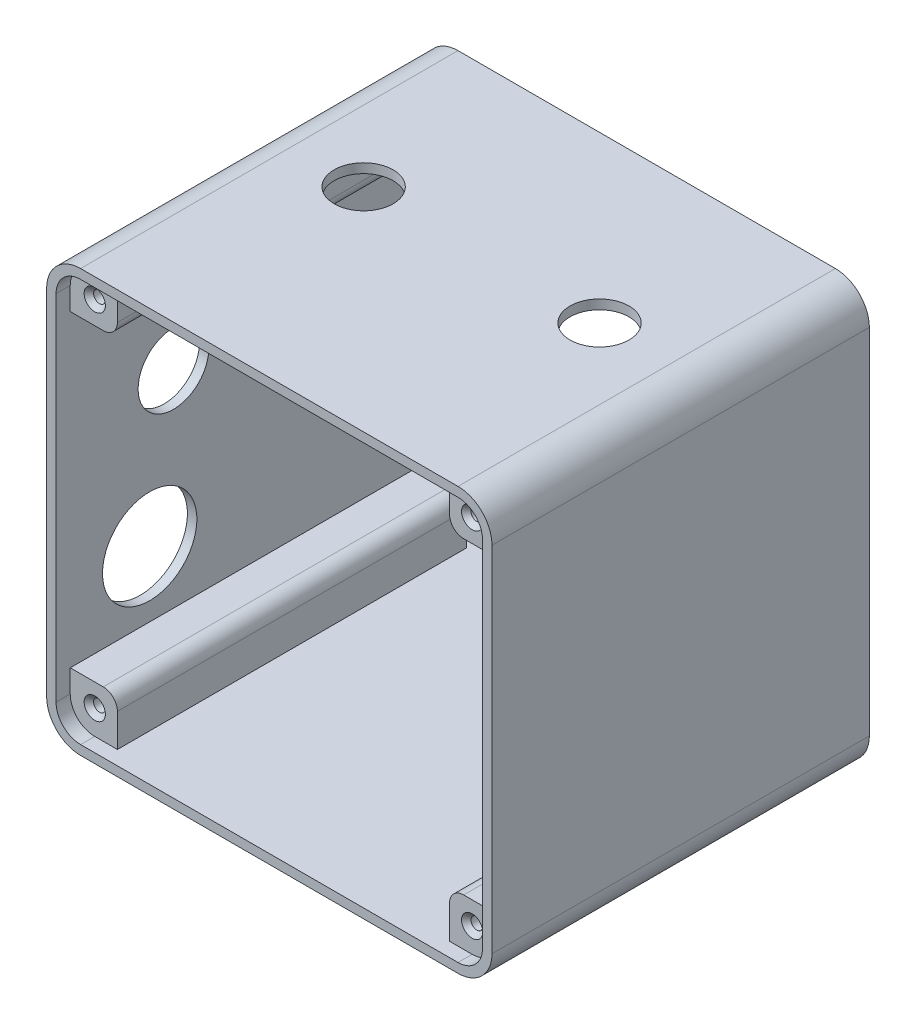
ISO-10303-21;
HEADER;
FILE_DESCRIPTION(('STEP AP214'),'2;1');
FILE_NAME('part.step','',(''),(''),'','','');
FILE_SCHEMA(('AUTOMOTIVE_DESIGN { 1 0 10303 214 1 1 1 1 }'));
ENDSEC;
DATA;
#1=APPLICATION_CONTEXT('core data for automotive mechanical design processes');
#2=APPLICATION_PROTOCOL_DEFINITION('international standard','automotive_design',2000,#1);
#3=PRODUCT_CONTEXT('',#1,'mechanical');
#4=PRODUCT('Part','Part','',(#3));
#5=PRODUCT_RELATED_PRODUCT_CATEGORY('part','',(#4));
#6=PRODUCT_DEFINITION_FORMATION('','',#4);
#7=PRODUCT_DEFINITION_CONTEXT('part definition',#1,'design');
#8=PRODUCT_DEFINITION('design','',#6,#7);
#9=PRODUCT_DEFINITION_SHAPE('','',#8);
#10=(LENGTH_UNIT() NAMED_UNIT(*) SI_UNIT(.MILLI.,.METRE.));
#11=(NAMED_UNIT(*) PLANE_ANGLE_UNIT() SI_UNIT($,.RADIAN.));
#12=(NAMED_UNIT(*) SI_UNIT($,.STERADIAN.) SOLID_ANGLE_UNIT());
#13=UNCERTAINTY_MEASURE_WITH_UNIT(LENGTH_MEASURE(1.E-05),#10,'distance_accuracy_value','');
#14=(GEOMETRIC_REPRESENTATION_CONTEXT(3) GLOBAL_UNCERTAINTY_ASSIGNED_CONTEXT((#13)) GLOBAL_UNIT_ASSIGNED_CONTEXT((#10,
#11,#12)) REPRESENTATION_CONTEXT('',''));
#15=CARTESIAN_POINT('',(0.,0.,0.));
#16=DIRECTION('',(0.,0.,1.));
#17=DIRECTION('',(1.,0.,0.));
#18=AXIS2_PLACEMENT_3D('',#15,#16,#17);
#19=CARTESIAN_POINT('',(-45.2,37.5,-77.));
#20=DIRECTION('',(-1.,0.,0.));
#21=DIRECTION('',(0.,-1.,0.));
#22=AXIS2_PLACEMENT_3D('',#19,#20,#21);
#23=PLANE('',#22);
#24=CARTESIAN_POINT('',(-45.2,-18.8054148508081,-16.84));
#25=DIRECTION('',(-1.,0.,0.));
#26=DIRECTION('',(0.,-1.,0.));
#27=AXIS2_PLACEMENT_3D('',#24,#25,#26);
#28=CIRCLE('',#27,10.);
#29=CARTESIAN_POINT('',(-45.2,-18.8054148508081,-6.84000000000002));
#30=VERTEX_POINT('',#29);
#31=EDGE_CURVE('E964',#30,#30,#28,.F.);
#32=ORIENTED_EDGE('',*,*,#31,.F.);
#33=EDGE_LOOP('',(#32));
#34=FACE_BOUND('',#33,.T.);
#35=CARTESIAN_POINT('',(-45.2,11.294585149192,-21.89));
#36=DIRECTION('',(-1.,0.,0.));
#37=DIRECTION('',(0.,-1.,0.));
#38=AXIS2_PLACEMENT_3D('',#35,#36,#37);
#39=CIRCLE('',#38,7.5);
#40=CARTESIAN_POINT('',(-45.2,11.294585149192,-14.39));
#41=VERTEX_POINT('',#40);
#42=EDGE_CURVE('E981',#41,#41,#39,.F.);
#43=ORIENTED_EDGE('',*,*,#42,.F.);
#44=EDGE_LOOP('',(#43));
#45=FACE_BOUND('',#44,.T.);
#46=DIRECTION('',(0.,1.,0.));
#47=VECTOR('',#46,1.);
#48=CARTESIAN_POINT('',(-45.2,-32.7,-74.));
#49=LINE('',#48,#47);
#50=CARTESIAN_POINT('',(-45.2,-37.5,-74.));
#51=VERTEX_POINT('',#50);
#52=CARTESIAN_POINT('',(-45.2,-32.7,-74.));
#53=VERTEX_POINT('',#52);
#54=EDGE_CURVE('E308',#51,#53,#49,.T.);
#55=ORIENTED_EDGE('',*,*,#54,.F.);
#56=DIRECTION('',(0.,0.,1.));
#57=VECTOR('',#56,1.);
#58=CARTESIAN_POINT('',(-45.2,-37.5,-77.));
#59=LINE('',#58,#57);
#60=CARTESIAN_POINT('',(-45.2,-37.5,-77.));
#61=VERTEX_POINT('',#60);
#62=EDGE_CURVE('E495',#61,#51,#59,.T.);
#63=ORIENTED_EDGE('',*,*,#62,.F.);
#64=DIRECTION('',(0.,-1.,0.));
#65=VECTOR('',#64,1.);
#66=CARTESIAN_POINT('',(-45.2,37.5,-77.));
#67=LINE('',#66,#65);
#68=CARTESIAN_POINT('',(-45.2,37.5,-77.));
#69=VERTEX_POINT('',#68);
#70=EDGE_CURVE('E469',#69,#61,#67,.T.);
#71=ORIENTED_EDGE('',*,*,#70,.F.);
#72=DIRECTION('',(0.,0.,1.));
#73=VECTOR('',#72,1.);
#74=CARTESIAN_POINT('',(-45.2,37.5,-77.));
#75=LINE('',#74,#73);
#76=CARTESIAN_POINT('',(-45.2,37.5,-74.));
#77=VERTEX_POINT('',#76);
#78=EDGE_CURVE('E499',#69,#77,#75,.T.);
#79=ORIENTED_EDGE('',*,*,#78,.T.);
#80=DIRECTION('',(0.,-1.,0.));
#81=VECTOR('',#80,1.);
#82=CARTESIAN_POINT('',(-45.2,32.7,-74.));
#83=LINE('',#82,#81);
#84=CARTESIAN_POINT('',(-45.2,32.7,-74.));
#85=VERTEX_POINT('',#84);
#86=EDGE_CURVE('E327',#77,#85,#83,.T.);
#87=ORIENTED_EDGE('',*,*,#86,.T.);
#88=DIRECTION('',(0.,0.,1.));
#89=VECTOR('',#88,1.);
#90=CARTESIAN_POINT('',(-45.2,32.7,-74.));
#91=LINE('',#90,#89);
#92=CARTESIAN_POINT('',(-45.2,32.7,0.));
#93=VERTEX_POINT('',#92);
#94=EDGE_CURVE('E345',#85,#93,#91,.T.);
#95=ORIENTED_EDGE('',*,*,#94,.T.);
#96=DIRECTION('',(0.,-1.,0.));
#97=VECTOR('',#96,1.);
#98=CARTESIAN_POINT('',(-45.2,32.7,0.));
#99=LINE('',#98,#97);
#100=CARTESIAN_POINT('',(-45.2,37.5,0.));
#101=VERTEX_POINT('',#100);
#102=EDGE_CURVE('E319',#101,#93,#99,.T.);
#103=ORIENTED_EDGE('',*,*,#102,.F.);
#104=CARTESIAN_POINT('',(-45.2,37.5,3.));
#105=VERTEX_POINT('',#104);
#106=EDGE_CURVE('E502',#101,#105,#75,.T.);
#107=ORIENTED_EDGE('',*,*,#106,.T.);
#108=DIRECTION('',(0.,-1.,0.));
#109=VECTOR('',#108,1.);
#110=CARTESIAN_POINT('',(-45.2,37.5,3.));
#111=LINE('',#110,#109);
#112=CARTESIAN_POINT('',(-45.2,-37.5,3.));
#113=VERTEX_POINT('',#112);
#114=EDGE_CURVE('E451',#105,#113,#111,.T.);
#115=ORIENTED_EDGE('',*,*,#114,.T.);
#116=CARTESIAN_POINT('',(-45.2,-37.5,0.));
#117=VERTEX_POINT('',#116);
#118=EDGE_CURVE('E498',#117,#113,#59,.T.);
#119=ORIENTED_EDGE('',*,*,#118,.F.);
#120=DIRECTION('',(0.,1.,0.));
#121=VECTOR('',#120,1.);
#122=CARTESIAN_POINT('',(-45.2,-32.7,0.));
#123=LINE('',#122,#121);
#124=CARTESIAN_POINT('',(-45.2,-32.7,0.));
#125=VERTEX_POINT('',#124);
#126=EDGE_CURVE('E55',#117,#125,#123,.T.);
#127=ORIENTED_EDGE('',*,*,#126,.T.);
#128=DIRECTION('',(0.,0.,1.));
#129=VECTOR('',#128,1.);
#130=CARTESIAN_POINT('',(-45.2,-32.7,-74.));
#131=LINE('',#130,#129);
#132=EDGE_CURVE('E302',#53,#125,#131,.T.);
#133=ORIENTED_EDGE('',*,*,#132,.F.);
#134=EDGE_LOOP('',(#55,#63,#71,#79,#87,#95,#103,#107,#115,#119,#127,#133));
#135=FACE_BOUND('',#134,.T.);
#136=ADVANCED_FACE('F39',(#34,#45,#135),#23,.F.);
#137=CARTESIAN_POINT('',(-40.,-42.7,-77.));
#138=DIRECTION('',(0.,-1.,0.));
#139=DIRECTION('',(0.,0.,-1.));
#140=AXIS2_PLACEMENT_3D('',#137,#138,#139);
#141=PLANE('',#140);
#142=DIRECTION('',(-1.,0.,0.));
#143=VECTOR('',#142,1.);
#144=CARTESIAN_POINT('',(-35.2,-42.7,-74.));
#145=LINE('',#144,#143);
#146=CARTESIAN_POINT('',(-35.2,-42.7,-74.));
#147=VERTEX_POINT('',#146);
#148=CARTESIAN_POINT('',(-39.9999999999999,-42.7,-74.));
#149=VERTEX_POINT('',#148);
#150=EDGE_CURVE('E944',#147,#149,#145,.T.);
#151=ORIENTED_EDGE('',*,*,#150,.F.);
#152=DIRECTION('',(0.,0.,1.));
#153=VECTOR('',#152,1.);
#154=CARTESIAN_POINT('',(-35.2,-42.7,-74.));
#155=LINE('',#154,#153);
#156=CARTESIAN_POINT('',(-35.2,-42.7,0.));
#157=VERTEX_POINT('',#156);
#158=EDGE_CURVE('E928',#147,#157,#155,.T.);
#159=ORIENTED_EDGE('',*,*,#158,.T.);
#160=DIRECTION('',(-1.,0.,0.));
#161=VECTOR('',#160,1.);
#162=CARTESIAN_POINT('',(-35.2,-42.7,0.));
#163=LINE('',#162,#161);
#164=CARTESIAN_POINT('',(-39.9999999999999,-42.7,0.));
#165=VERTEX_POINT('',#164);
#166=EDGE_CURVE('E922',#157,#165,#163,.T.);
#167=ORIENTED_EDGE('',*,*,#166,.T.);
#168=DIRECTION('',(0.,0.,1.));
#169=VECTOR('',#168,1.);
#170=CARTESIAN_POINT('',(-40.,-42.7,-77.));
#171=LINE('',#170,#169);
#172=CARTESIAN_POINT('',(-40.,-42.7,3.));
#173=VERTEX_POINT('',#172);
#174=EDGE_CURVE('E472',#165,#173,#171,.T.);
#175=ORIENTED_EDGE('',*,*,#174,.T.);
#176=DIRECTION('',(1.,0.,0.));
#177=VECTOR('',#176,1.);
#178=CARTESIAN_POINT('',(-40.,-42.7,3.));
#179=LINE('',#178,#177);
#180=CARTESIAN_POINT('',(40.,-42.7,3.));
#181=VERTEX_POINT('',#180);
#182=EDGE_CURVE('E475',#173,#181,#179,.T.);
#183=ORIENTED_EDGE('',*,*,#182,.T.);
#184=DIRECTION('',(0.,0.,1.));
#185=VECTOR('',#184,1.);
#186=CARTESIAN_POINT('',(40.,-42.7,-77.));
#187=LINE('',#186,#185);
#188=CARTESIAN_POINT('',(39.9999999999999,-42.7,0.));
#189=VERTEX_POINT('',#188);
#190=EDGE_CURVE('E522',#189,#181,#187,.T.);
#191=ORIENTED_EDGE('',*,*,#190,.F.);
#192=DIRECTION('',(1.,0.,0.));
#193=VECTOR('',#192,1.);
#194=CARTESIAN_POINT('',(35.2,-42.7,0.));
#195=LINE('',#194,#193);
#196=CARTESIAN_POINT('',(35.2,-42.7,0.));
#197=VERTEX_POINT('',#196);
#198=EDGE_CURVE('E388',#197,#189,#195,.T.);
#199=ORIENTED_EDGE('',*,*,#198,.F.);
#200=DIRECTION('',(0.,0.,1.));
#201=VECTOR('',#200,1.);
#202=CARTESIAN_POINT('',(35.2,-42.7,-74.));
#203=LINE('',#202,#201);
#204=CARTESIAN_POINT('',(35.2,-42.7,-74.));
#205=VERTEX_POINT('',#204);
#206=EDGE_CURVE('E403',#205,#197,#203,.T.);
#207=ORIENTED_EDGE('',*,*,#206,.F.);
#208=DIRECTION('',(1.,0.,0.));
#209=VECTOR('',#208,1.);
#210=CARTESIAN_POINT('',(35.2,-42.7,-74.));
#211=LINE('',#210,#209);
#212=CARTESIAN_POINT('',(39.9999999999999,-42.7,-74.));
#213=VERTEX_POINT('',#212);
#214=EDGE_CURVE('E372',#205,#213,#211,.T.);
#215=ORIENTED_EDGE('',*,*,#214,.T.);
#216=CARTESIAN_POINT('',(40.,-42.7,-77.));
#217=VERTEX_POINT('',#216);
#218=EDGE_CURVE('E519',#217,#213,#187,.T.);
#219=ORIENTED_EDGE('',*,*,#218,.F.);
#220=DIRECTION('',(1.,0.,0.));
#221=VECTOR('',#220,1.);
#222=CARTESIAN_POINT('',(-40.,-42.7,-77.));
#223=LINE('',#222,#221);
#224=CARTESIAN_POINT('',(-40.,-42.7,-77.));
#225=VERTEX_POINT('',#224);
#226=EDGE_CURVE('E450',#225,#217,#223,.T.);
#227=ORIENTED_EDGE('',*,*,#226,.F.);
#228=EDGE_CURVE('E523',#225,#149,#171,.T.);
#229=ORIENTED_EDGE('',*,*,#228,.T.);
#230=EDGE_LOOP('',(#151,#159,#167,#175,#183,#191,#199,#207,#215,#219,#227,#229));
#231=FACE_BOUND('',#230,.T.);
#232=ADVANCED_FACE('F651',(#231),#141,.F.);
#233=CARTESIAN_POINT('',(-40.,-37.5,-77.));
#234=DIRECTION('',(0.,0.,1.));
#235=DIRECTION('',(1.,0.,0.));
#236=AXIS2_PLACEMENT_3D('',#233,#234,#235);
#237=CYLINDRICAL_SURFACE('',#236,5.2);
#238=CARTESIAN_POINT('',(-40.,-37.5,-74.));
#239=DIRECTION('',(0.,0.,-1.));
#240=DIRECTION('',(-1.,0.,0.));
#241=AXIS2_PLACEMENT_3D('',#238,#239,#240);
#242=CIRCLE('',#241,5.20000000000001);
#243=EDGE_CURVE('E313',#149,#51,#242,.T.);
#244=ORIENTED_EDGE('',*,*,#243,.F.);
#245=ORIENTED_EDGE('',*,*,#228,.F.);
#246=CARTESIAN_POINT('',(-40.,-37.5,-77.));
#247=DIRECTION('',(0.,0.,1.));
#248=DIRECTION('',(1.,0.,0.));
#249=AXIS2_PLACEMENT_3D('',#246,#247,#248);
#250=CIRCLE('',#249,5.2);
#251=EDGE_CURVE('E447',#61,#225,#250,.T.);
#252=ORIENTED_EDGE('',*,*,#251,.F.);
#253=ORIENTED_EDGE('',*,*,#62,.T.);
#254=EDGE_LOOP('',(#244,#245,#252,#253));
#255=FACE_BOUND('',#254,.T.);
#256=ADVANCED_FACE('F657',(#255),#237,.F.);
#257=CARTESIAN_POINT('',(39.9999999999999,42.7,-77.));
#258=DIRECTION('',(0.,1.,0.));
#259=DIRECTION('',(0.,0.,1.));
#260=AXIS2_PLACEMENT_3D('',#257,#258,#259);
#261=PLANE('',#260);
#262=CARTESIAN_POINT('',(25.,42.7,-42.));
#263=DIRECTION('',(0.,1.,0.));
#264=DIRECTION('',(0.,0.,1.));
#265=AXIS2_PLACEMENT_3D('',#262,#263,#264);
#266=CIRCLE('',#265,6.25);
#267=CARTESIAN_POINT('',(25.,42.7,-35.75));
#268=VERTEX_POINT('',#267);
#269=EDGE_CURVE('E982',#268,#268,#266,.T.);
#270=ORIENTED_EDGE('',*,*,#269,.T.);
#271=EDGE_LOOP('',(#270));
#272=FACE_BOUND('',#271,.T.);
#273=CARTESIAN_POINT('',(-25.,42.7,-42.));
#274=DIRECTION('',(0.,1.,0.));
#275=DIRECTION('',(0.,0.,1.));
#276=AXIS2_PLACEMENT_3D('',#273,#274,#275);
#277=CIRCLE('',#276,6.25);
#278=CARTESIAN_POINT('',(-25.,42.7,-35.75));
#279=VERTEX_POINT('',#278);
#280=EDGE_CURVE('E942',#279,#279,#277,.F.);
#281=ORIENTED_EDGE('',*,*,#280,.F.);
#282=EDGE_LOOP('',(#281));
#283=FACE_BOUND('',#282,.T.);
#284=DIRECTION('',(-1.,0.,0.));
#285=VECTOR('',#284,1.);
#286=CARTESIAN_POINT('',(-35.2,42.7,-74.));
#287=LINE('',#286,#285);
#288=CARTESIAN_POINT('',(-35.2,42.7,-74.));
#289=VERTEX_POINT('',#288);
#290=CARTESIAN_POINT('',(-39.9999999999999,42.7,-74.));
#291=VERTEX_POINT('',#290);
#292=EDGE_CURVE('E334',#289,#291,#287,.T.);
#293=ORIENTED_EDGE('',*,*,#292,.T.);
#294=DIRECTION('',(0.,0.,1.));
#295=VECTOR('',#294,1.);
#296=CARTESIAN_POINT('',(-40.,42.7,-77.));
#297=LINE('',#296,#295);
#298=CARTESIAN_POINT('',(-40.,42.7,-77.));
#299=VERTEX_POINT('',#298);
#300=EDGE_CURVE('E503',#299,#291,#297,.T.);
#301=ORIENTED_EDGE('',*,*,#300,.F.);
#302=DIRECTION('',(-1.,0.,0.));
#303=VECTOR('',#302,1.);
#304=CARTESIAN_POINT('',(39.9999999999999,42.7,-77.));
#305=LINE('',#304,#303);
#306=CARTESIAN_POINT('',(39.9999999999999,42.7,-77.));
#307=VERTEX_POINT('',#306);
#308=EDGE_CURVE('E463',#307,#299,#305,.T.);
#309=ORIENTED_EDGE('',*,*,#308,.F.);
#310=DIRECTION('',(0.,0.,1.));
#311=VECTOR('',#310,1.);
#312=CARTESIAN_POINT('',(39.9999999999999,42.7,-77.));
#313=LINE('',#312,#311);
#314=CARTESIAN_POINT('',(39.9999999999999,42.7,-74.));
#315=VERTEX_POINT('',#314);
#316=EDGE_CURVE('E507',#307,#315,#313,.T.);
#317=ORIENTED_EDGE('',*,*,#316,.T.);
#318=DIRECTION('',(1.,0.,0.));
#319=VECTOR('',#318,1.);
#320=CARTESIAN_POINT('',(35.2,42.7,-74.));
#321=LINE('',#320,#319);
#322=CARTESIAN_POINT('',(35.2,42.7,-74.));
#323=VERTEX_POINT('',#322);
#324=EDGE_CURVE('E418',#323,#315,#321,.T.);
#325=ORIENTED_EDGE('',*,*,#324,.F.);
#326=DIRECTION('',(0.,0.,1.));
#327=VECTOR('',#326,1.);
#328=CARTESIAN_POINT('',(35.2,42.7,-74.));
#329=LINE('',#328,#327);
#330=CARTESIAN_POINT('',(35.2,42.7,0.));
#331=VERTEX_POINT('',#330);
#332=EDGE_CURVE('E424',#323,#331,#329,.T.);
#333=ORIENTED_EDGE('',*,*,#332,.T.);
#334=DIRECTION('',(1.,0.,0.));
#335=VECTOR('',#334,1.);
#336=CARTESIAN_POINT('',(35.2,42.7,0.));
#337=LINE('',#336,#335);
#338=CARTESIAN_POINT('',(39.9999999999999,42.7,0.));
#339=VERTEX_POINT('',#338);
#340=EDGE_CURVE('E433',#331,#339,#337,.T.);
#341=ORIENTED_EDGE('',*,*,#340,.T.);
#342=CARTESIAN_POINT('',(39.9999999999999,42.7,3.));
#343=VERTEX_POINT('',#342);
#344=EDGE_CURVE('E510',#339,#343,#313,.T.);
#345=ORIENTED_EDGE('',*,*,#344,.T.);
#346=DIRECTION('',(-1.,0.,0.));
#347=VECTOR('',#346,1.);
#348=CARTESIAN_POINT('',(39.9999999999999,42.7,3.));
#349=LINE('',#348,#347);
#350=CARTESIAN_POINT('',(-40.,42.7,3.));
#351=VERTEX_POINT('',#350);
#352=EDGE_CURVE('E487',#343,#351,#349,.T.);
#353=ORIENTED_EDGE('',*,*,#352,.T.);
#354=CARTESIAN_POINT('',(-40.,42.7,0.));
#355=VERTEX_POINT('',#354);
#356=EDGE_CURVE('E506',#355,#351,#297,.T.);
#357=ORIENTED_EDGE('',*,*,#356,.F.);
#358=DIRECTION('',(-1.,0.,0.));
#359=VECTOR('',#358,1.);
#360=CARTESIAN_POINT('',(-35.2,42.7,0.));
#361=LINE('',#360,#359);
#362=CARTESIAN_POINT('',(-35.2,42.7,0.));
#363=VERTEX_POINT('',#362);
#364=EDGE_CURVE('E63',#363,#355,#361,.T.);
#365=ORIENTED_EDGE('',*,*,#364,.F.);
#366=DIRECTION('',(0.,0.,1.));
#367=VECTOR('',#366,1.);
#368=CARTESIAN_POINT('',(-35.2,42.7,-74.));
#369=LINE('',#368,#367);
#370=EDGE_CURVE('E362',#289,#363,#369,.T.);
#371=ORIENTED_EDGE('',*,*,#370,.F.);
#372=EDGE_LOOP('',(#293,#301,#309,#317,#325,#333,#341,#345,#353,#357,#365,#371));
#373=FACE_BOUND('',#372,.T.);
#374=ADVANCED_FACE('F673',(#272,#283,#373),#261,.F.);
#375=CARTESIAN_POINT('',(-40.,37.5,-77.));
#376=DIRECTION('',(0.,0.,1.));
#377=DIRECTION('',(1.,0.,0.));
#378=AXIS2_PLACEMENT_3D('',#375,#376,#377);
#379=CYLINDRICAL_SURFACE('',#378,5.2);
#380=CARTESIAN_POINT('',(-40.,37.5,-74.));
#381=DIRECTION('',(0.,0.,1.));
#382=DIRECTION('',(-1.,0.,0.));
#383=AXIS2_PLACEMENT_3D('',#380,#381,#382);
#384=CIRCLE('',#383,5.20000000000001);
#385=EDGE_CURVE('E330',#291,#77,#384,.T.);
#386=ORIENTED_EDGE('',*,*,#385,.T.);
#387=ORIENTED_EDGE('',*,*,#78,.F.);
#388=CARTESIAN_POINT('',(-40.,37.5,-77.));
#389=DIRECTION('',(0.,0.,1.));
#390=DIRECTION('',(1.,0.,0.));
#391=AXIS2_PLACEMENT_3D('',#388,#389,#390);
#392=CIRCLE('',#391,5.2);
#393=EDGE_CURVE('E466',#299,#69,#392,.T.);
#394=ORIENTED_EDGE('',*,*,#393,.F.);
#395=ORIENTED_EDGE('',*,*,#300,.T.);
#396=EDGE_LOOP('',(#386,#387,#394,#395));
#397=FACE_BOUND('',#396,.T.);
#398=ADVANCED_FACE('F672',(#397),#379,.F.);
#399=CARTESIAN_POINT('',(45.2,-37.5,-77.));
#400=DIRECTION('',(1.,0.,0.));
#401=DIRECTION('',(0.,1.,0.));
#402=AXIS2_PLACEMENT_3D('',#399,#400,#401);
#403=PLANE('',#402);
#404=DIRECTION('',(0.,1.,0.));
#405=VECTOR('',#404,1.);
#406=CARTESIAN_POINT('',(45.2,-32.7,-74.));
#407=LINE('',#406,#405);
#408=CARTESIAN_POINT('',(45.2,-37.5,-74.));
#409=VERTEX_POINT('',#408);
#410=CARTESIAN_POINT('',(45.2,-32.7,-74.));
#411=VERTEX_POINT('',#410);
#412=EDGE_CURVE('E365',#409,#411,#407,.T.);
#413=ORIENTED_EDGE('',*,*,#412,.T.);
#414=DIRECTION('',(0.,0.,1.));
#415=VECTOR('',#414,1.);
#416=CARTESIAN_POINT('',(45.2,-32.7,-74.));
#417=LINE('',#416,#415);
#418=CARTESIAN_POINT('',(45.2,-32.7,0.));
#419=VERTEX_POINT('',#418);
#420=EDGE_CURVE('E384',#411,#419,#417,.T.);
#421=ORIENTED_EDGE('',*,*,#420,.T.);
#422=DIRECTION('',(0.,1.,0.));
#423=VECTOR('',#422,1.);
#424=CARTESIAN_POINT('',(45.2,-32.7,0.));
#425=LINE('',#424,#423);
#426=CARTESIAN_POINT('',(45.2,-37.5,0.));
#427=VERTEX_POINT('',#426);
#428=EDGE_CURVE('E364',#427,#419,#425,.T.);
#429=ORIENTED_EDGE('',*,*,#428,.F.);
#430=DIRECTION('',(0.,0.,1.));
#431=VECTOR('',#430,1.);
#432=CARTESIAN_POINT('',(45.2,-37.5,-77.));
#433=LINE('',#432,#431);
#434=CARTESIAN_POINT('',(45.2,-37.5,3.));
#435=VERTEX_POINT('',#434);
#436=EDGE_CURVE('E518',#427,#435,#433,.T.);
#437=ORIENTED_EDGE('',*,*,#436,.T.);
#438=DIRECTION('',(0.,1.,0.));
#439=VECTOR('',#438,1.);
#440=CARTESIAN_POINT('',(45.2,-37.5,3.));
#441=LINE('',#440,#439);
#442=CARTESIAN_POINT('',(45.2,37.5,3.));
#443=VERTEX_POINT('',#442);
#444=EDGE_CURVE('E481',#435,#443,#441,.T.);
#445=ORIENTED_EDGE('',*,*,#444,.T.);
#446=DIRECTION('',(0.,0.,1.));
#447=VECTOR('',#446,1.);
#448=CARTESIAN_POINT('',(45.2,37.5,-77.));
#449=LINE('',#448,#447);
#450=CARTESIAN_POINT('',(45.2,37.5,0.));
#451=VERTEX_POINT('',#450);
#452=EDGE_CURVE('E514',#451,#443,#449,.T.);
#453=ORIENTED_EDGE('',*,*,#452,.F.);
#454=DIRECTION('',(0.,-1.,0.));
#455=VECTOR('',#454,1.);
#456=CARTESIAN_POINT('',(45.2,32.7,0.));
#457=LINE('',#456,#455);
#458=CARTESIAN_POINT('',(45.2,32.7,0.));
#459=VERTEX_POINT('',#458);
#460=EDGE_CURVE('E406',#451,#459,#457,.T.);
#461=ORIENTED_EDGE('',*,*,#460,.T.);
#462=DIRECTION('',(0.,0.,1.));
#463=VECTOR('',#462,1.);
#464=CARTESIAN_POINT('',(45.2,32.7,-74.));
#465=LINE('',#464,#463);
#466=CARTESIAN_POINT('',(45.2,32.7,-74.));
#467=VERTEX_POINT('',#466);
#468=EDGE_CURVE('E443',#467,#459,#465,.T.);
#469=ORIENTED_EDGE('',*,*,#468,.F.);
#470=DIRECTION('',(0.,-1.,0.));
#471=VECTOR('',#470,1.);
#472=CARTESIAN_POINT('',(45.2,32.7,-74.));
#473=LINE('',#472,#471);
#474=CARTESIAN_POINT('',(45.2,37.5,-74.));
#475=VERTEX_POINT('',#474);
#476=EDGE_CURVE('E407',#475,#467,#473,.T.);
#477=ORIENTED_EDGE('',*,*,#476,.F.);
#478=CARTESIAN_POINT('',(45.2,37.5,-77.));
#479=VERTEX_POINT('',#478);
#480=EDGE_CURVE('E511',#479,#475,#449,.T.);
#481=ORIENTED_EDGE('',*,*,#480,.F.);
#482=DIRECTION('',(0.,1.,0.));
#483=VECTOR('',#482,1.);
#484=CARTESIAN_POINT('',(45.2,-37.5,-77.));
#485=LINE('',#484,#483);
#486=CARTESIAN_POINT('',(45.2,-37.5,-77.));
#487=VERTEX_POINT('',#486);
#488=EDGE_CURVE('E457',#487,#479,#485,.T.);
#489=ORIENTED_EDGE('',*,*,#488,.F.);
#490=EDGE_CURVE('E515',#487,#409,#433,.T.);
#491=ORIENTED_EDGE('',*,*,#490,.T.);
#492=EDGE_LOOP('',(#413,#421,#429,#437,#445,#453,#461,#469,#477,#481,#489,#491));
#493=FACE_BOUND('',#492,.T.);
#494=ADVANCED_FACE('F682',(#493),#403,.F.);
#495=CARTESIAN_POINT('',(40.,-37.5,-77.));
#496=DIRECTION('',(0.,0.,1.));
#497=DIRECTION('',(1.,0.,0.));
#498=AXIS2_PLACEMENT_3D('',#495,#496,#497);
#499=CYLINDRICAL_SURFACE('',#498,5.2);
#500=CARTESIAN_POINT('',(40.,-37.5,-74.));
#501=DIRECTION('',(0.,0.,1.));
#502=DIRECTION('',(1.,0.,0.));
#503=AXIS2_PLACEMENT_3D('',#500,#501,#502);
#504=CIRCLE('',#503,5.20000000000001);
#505=EDGE_CURVE('E368',#213,#409,#504,.T.);
#506=ORIENTED_EDGE('',*,*,#505,.T.);
#507=ORIENTED_EDGE('',*,*,#490,.F.);
#508=CARTESIAN_POINT('',(40.,-37.5,-77.));
#509=DIRECTION('',(0.,0.,1.));
#510=DIRECTION('',(1.,0.,0.));
#511=AXIS2_PLACEMENT_3D('',#508,#509,#510);
#512=CIRCLE('',#511,5.2);
#513=EDGE_CURVE('E454',#217,#487,#512,.T.);
#514=ORIENTED_EDGE('',*,*,#513,.F.);
#515=ORIENTED_EDGE('',*,*,#218,.T.);
#516=EDGE_LOOP('',(#506,#507,#514,#515));
#517=FACE_BOUND('',#516,.T.);
#518=ADVANCED_FACE('F685',(#517),#499,.F.);
#519=CARTESIAN_POINT('',(40.,37.5,-77.));
#520=DIRECTION('',(0.,0.,1.));
#521=DIRECTION('',(1.,0.,0.));
#522=AXIS2_PLACEMENT_3D('',#519,#520,#521);
#523=CYLINDRICAL_SURFACE('',#522,5.2);
#524=CARTESIAN_POINT('',(40.,37.5,-74.));
#525=DIRECTION('',(0.,0.,-1.));
#526=DIRECTION('',(1.,0.,0.));
#527=AXIS2_PLACEMENT_3D('',#524,#525,#526);
#528=CIRCLE('',#527,5.20000000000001);
#529=EDGE_CURVE('E421',#315,#475,#528,.T.);
#530=ORIENTED_EDGE('',*,*,#529,.F.);
#531=ORIENTED_EDGE('',*,*,#316,.F.);
#532=CARTESIAN_POINT('',(40.,37.5,-77.));
#533=DIRECTION('',(0.,0.,1.));
#534=DIRECTION('',(1.,0.,0.));
#535=AXIS2_PLACEMENT_3D('',#532,#533,#534);
#536=CIRCLE('',#535,5.2);
#537=EDGE_CURVE('E460',#479,#307,#536,.T.);
#538=ORIENTED_EDGE('',*,*,#537,.F.);
#539=ORIENTED_EDGE('',*,*,#480,.T.);
#540=EDGE_LOOP('',(#530,#531,#538,#539));
#541=FACE_BOUND('',#540,.T.);
#542=ADVANCED_FACE('F681',(#541),#523,.F.);
#543=CARTESIAN_POINT('',(-40.,-37.5,-77.));
#544=DIRECTION('',(0.,0.,1.));
#545=DIRECTION('',(1.,0.,0.));
#546=AXIS2_PLACEMENT_3D('',#543,#544,#545);
#547=CYLINDRICAL_SURFACE('',#546,7.2);
#548=CARTESIAN_POINT('',(-40.,-37.5,3.));
#549=DIRECTION('',(0.,0.,1.));
#550=DIRECTION('',(1.,0.,0.));
#551=AXIS2_PLACEMENT_3D('',#548,#549,#550);
#552=CIRCLE('',#551,7.2);
#553=CARTESIAN_POINT('',(-47.2,-37.5,3.));
#554=VERTEX_POINT('',#553);
#555=CARTESIAN_POINT('',(-40.,-44.7,3.));
#556=VERTEX_POINT('',#555);
#557=EDGE_CURVE('E497',#554,#556,#552,.T.);
#558=ORIENTED_EDGE('',*,*,#557,.F.);
#559=DIRECTION('',(0.,0.,1.));
#560=VECTOR('',#559,1.);
#561=CARTESIAN_POINT('',(-47.2,-37.5,-77.));
#562=LINE('',#561,#560);
#563=CARTESIAN_POINT('',(-47.2,-37.5,-77.));
#564=VERTEX_POINT('',#563);
#565=EDGE_CURVE('E574',#564,#554,#562,.T.);
#566=ORIENTED_EDGE('',*,*,#565,.F.);
#567=CARTESIAN_POINT('',(-40.,-37.5,-77.));
#568=DIRECTION('',(0.,0.,1.));
#569=DIRECTION('',(1.,0.,0.));
#570=AXIS2_PLACEMENT_3D('',#567,#568,#569);
#571=CIRCLE('',#570,7.2);
#572=CARTESIAN_POINT('',(-40.,-44.7,-77.));
#573=VERTEX_POINT('',#572);
#574=EDGE_CURVE('E526',#564,#573,#571,.T.);
#575=ORIENTED_EDGE('',*,*,#574,.T.);
#576=DIRECTION('',(0.,0.,1.));
#577=VECTOR('',#576,1.);
#578=CARTESIAN_POINT('',(-40.,-44.7,-77.));
#579=LINE('',#578,#577);
#580=EDGE_CURVE('E551',#573,#556,#579,.T.);
#581=ORIENTED_EDGE('',*,*,#580,.T.);
#582=EDGE_LOOP('',(#558,#566,#575,#581));
#583=FACE_BOUND('',#582,.T.);
#584=ADVANCED_FACE('F707',(#583),#547,.T.);
#585=CARTESIAN_POINT('',(-47.2,37.5,-77.));
#586=DIRECTION('',(-1.,0.,0.));
#587=DIRECTION('',(0.,-1.,0.));
#588=AXIS2_PLACEMENT_3D('',#585,#586,#587);
#589=PLANE('',#588);
#590=CARTESIAN_POINT('',(-47.2,-18.8054148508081,-16.84));
#591=DIRECTION('',(-1.,0.,0.));
#592=DIRECTION('',(0.,0.,1.));
#593=AXIS2_PLACEMENT_3D('',#590,#591,#592);
#594=CIRCLE('',#593,10.);
#595=CARTESIAN_POINT('',(-47.2,-18.8054148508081,-6.84000000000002));
#596=VERTEX_POINT('',#595);
#597=EDGE_CURVE('E985',#596,#596,#594,.T.);
#598=ORIENTED_EDGE('',*,*,#597,.F.);
#599=EDGE_LOOP('',(#598));
#600=FACE_BOUND('',#599,.T.);
#601=CARTESIAN_POINT('',(-47.2,11.294585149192,-21.89));
#602=DIRECTION('',(-1.,0.,0.));
#603=DIRECTION('',(0.,0.,1.));
#604=AXIS2_PLACEMENT_3D('',#601,#602,#603);
#605=CIRCLE('',#604,7.5);
#606=CARTESIAN_POINT('',(-47.2,11.294585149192,-14.39));
#607=VERTEX_POINT('',#606);
#608=EDGE_CURVE('E978',#607,#607,#605,.T.);
#609=ORIENTED_EDGE('',*,*,#608,.F.);
#610=EDGE_LOOP('',(#609));
#611=FACE_BOUND('',#610,.T.);
#612=DIRECTION('',(0.,-1.,0.));
#613=VECTOR('',#612,1.);
#614=CARTESIAN_POINT('',(-47.2,37.5,3.));
#615=LINE('',#614,#613);
#616=CARTESIAN_POINT('',(-47.2,37.5,3.));
#617=VERTEX_POINT('',#616);
#618=EDGE_CURVE('E530',#617,#554,#615,.T.);
#619=ORIENTED_EDGE('',*,*,#618,.F.);
#620=DIRECTION('',(0.,0.,1.));
#621=VECTOR('',#620,1.);
#622=CARTESIAN_POINT('',(-47.2,37.5,-77.));
#623=LINE('',#622,#621);
#624=CARTESIAN_POINT('',(-47.2,37.5,-77.));
#625=VERTEX_POINT('',#624);
#626=EDGE_CURVE('E577',#625,#617,#623,.T.);
#627=ORIENTED_EDGE('',*,*,#626,.F.);
#628=DIRECTION('',(0.,-1.,0.));
#629=VECTOR('',#628,1.);
#630=CARTESIAN_POINT('',(-47.2,37.5,-77.));
#631=LINE('',#630,#629);
#632=EDGE_CURVE('E548',#625,#564,#631,.T.);
#633=ORIENTED_EDGE('',*,*,#632,.T.);
#634=ORIENTED_EDGE('',*,*,#565,.T.);
#635=EDGE_LOOP('',(#619,#627,#633,#634));
#636=FACE_BOUND('',#635,.T.);
#637=ADVANCED_FACE('F703',(#600,#611,#636),#589,.T.);
#638=CARTESIAN_POINT('',(-40.,37.5,-77.));
#639=DIRECTION('',(0.,0.,1.));
#640=DIRECTION('',(1.,0.,0.));
#641=AXIS2_PLACEMENT_3D('',#638,#639,#640);
#642=CYLINDRICAL_SURFACE('',#641,7.19999999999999);
#643=CARTESIAN_POINT('',(-40.,37.5,3.));
#644=DIRECTION('',(0.,0.,1.));
#645=DIRECTION('',(1.,0.,0.));
#646=AXIS2_PLACEMENT_3D('',#643,#644,#645);
#647=CIRCLE('',#646,7.19999999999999);
#648=CARTESIAN_POINT('',(-40.,44.7,3.));
#649=VERTEX_POINT('',#648);
#650=EDGE_CURVE('E569',#649,#617,#647,.T.);
#651=ORIENTED_EDGE('',*,*,#650,.F.);
#652=DIRECTION('',(0.,0.,1.));
#653=VECTOR('',#652,1.);
#654=CARTESIAN_POINT('',(-40.,44.7,-77.));
#655=LINE('',#654,#653);
#656=CARTESIAN_POINT('',(-40.,44.7,-77.));
#657=VERTEX_POINT('',#656);
#658=EDGE_CURVE('E579',#657,#649,#655,.T.);
#659=ORIENTED_EDGE('',*,*,#658,.F.);
#660=CARTESIAN_POINT('',(-40.,37.5,-77.));
#661=DIRECTION('',(0.,0.,1.));
#662=DIRECTION('',(1.,0.,0.));
#663=AXIS2_PLACEMENT_3D('',#660,#661,#662);
#664=CIRCLE('',#663,7.19999999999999);
#665=EDGE_CURVE('E545',#657,#625,#664,.T.);
#666=ORIENTED_EDGE('',*,*,#665,.T.);
#667=ORIENTED_EDGE('',*,*,#626,.T.);
#668=EDGE_LOOP('',(#651,#659,#666,#667));
#669=FACE_BOUND('',#668,.T.);
#670=ADVANCED_FACE('F706',(#669),#642,.T.);
#671=CARTESIAN_POINT('',(39.9999999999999,44.7,-77.));
#672=DIRECTION('',(0.,1.,0.));
#673=DIRECTION('',(-1.,0.,0.));
#674=AXIS2_PLACEMENT_3D('',#671,#672,#673);
#675=PLANE('',#674);
#676=CARTESIAN_POINT('',(25.,44.7,-42.));
#677=DIRECTION('',(0.,-1.,0.));
#678=DIRECTION('',(0.,0.,1.));
#679=AXIS2_PLACEMENT_3D('',#676,#677,#678);
#680=CIRCLE('',#679,6.25);
#681=CARTESIAN_POINT('',(25.,44.7,-35.75));
#682=VERTEX_POINT('',#681);
#683=EDGE_CURVE('E990',#682,#682,#680,.T.);
#684=ORIENTED_EDGE('',*,*,#683,.T.);
#685=EDGE_LOOP('',(#684));
#686=FACE_BOUND('',#685,.T.);
#687=CARTESIAN_POINT('',(-25.,44.7,-42.));
#688=DIRECTION('',(0.,1.,0.));
#689=DIRECTION('',(0.,0.,1.));
#690=AXIS2_PLACEMENT_3D('',#687,#688,#689);
#691=CIRCLE('',#690,6.25);
#692=CARTESIAN_POINT('',(-25.,44.7,-35.75));
#693=VERTEX_POINT('',#692);
#694=EDGE_CURVE('E948',#693,#693,#691,.T.);
#695=ORIENTED_EDGE('',*,*,#694,.F.);
#696=EDGE_LOOP('',(#695));
#697=FACE_BOUND('',#696,.T.);
#698=DIRECTION('',(-1.,0.,0.));
#699=VECTOR('',#698,1.);
#700=CARTESIAN_POINT('',(39.9999999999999,44.7,3.));
#701=LINE('',#700,#699);
#702=CARTESIAN_POINT('',(39.9999999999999,44.7,3.));
#703=VERTEX_POINT('',#702);
#704=EDGE_CURVE('E566',#703,#649,#701,.T.);
#705=ORIENTED_EDGE('',*,*,#704,.F.);
#706=DIRECTION('',(0.,0.,1.));
#707=VECTOR('',#706,1.);
#708=CARTESIAN_POINT('',(39.9999999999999,44.7,-77.));
#709=LINE('',#708,#707);
#710=CARTESIAN_POINT('',(39.9999999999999,44.7,-77.));
#711=VERTEX_POINT('',#710);
#712=EDGE_CURVE('E581',#711,#703,#709,.T.);
#713=ORIENTED_EDGE('',*,*,#712,.F.);
#714=DIRECTION('',(-1.,0.,0.));
#715=VECTOR('',#714,1.);
#716=CARTESIAN_POINT('',(39.9999999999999,44.7,-77.));
#717=LINE('',#716,#715);
#718=EDGE_CURVE('E542',#711,#657,#717,.T.);
#719=ORIENTED_EDGE('',*,*,#718,.T.);
#720=ORIENTED_EDGE('',*,*,#658,.T.);
#721=EDGE_LOOP('',(#705,#713,#719,#720));
#722=FACE_BOUND('',#721,.T.);
#723=ADVANCED_FACE('F711',(#686,#697,#722),#675,.T.);
#724=CARTESIAN_POINT('',(40.,37.5,-77.));
#725=DIRECTION('',(0.,0.,1.));
#726=DIRECTION('',(1.,0.,0.));
#727=AXIS2_PLACEMENT_3D('',#724,#725,#726);
#728=CYLINDRICAL_SURFACE('',#727,7.20000000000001);
#729=CARTESIAN_POINT('',(40.,37.5,3.));
#730=DIRECTION('',(0.,0.,1.));
#731=DIRECTION('',(1.,0.,0.));
#732=AXIS2_PLACEMENT_3D('',#729,#730,#731);
#733=CIRCLE('',#732,7.20000000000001);
#734=CARTESIAN_POINT('',(47.2,37.5,3.));
#735=VERTEX_POINT('',#734);
#736=EDGE_CURVE('E563',#735,#703,#733,.T.);
#737=ORIENTED_EDGE('',*,*,#736,.F.);
#738=DIRECTION('',(0.,0.,1.));
#739=VECTOR('',#738,1.);
#740=CARTESIAN_POINT('',(47.2,37.5,-77.));
#741=LINE('',#740,#739);
#742=CARTESIAN_POINT('',(47.2,37.5,-77.));
#743=VERTEX_POINT('',#742);
#744=EDGE_CURVE('E583',#743,#735,#741,.T.);
#745=ORIENTED_EDGE('',*,*,#744,.F.);
#746=CARTESIAN_POINT('',(40.,37.5,-77.));
#747=DIRECTION('',(0.,0.,1.));
#748=DIRECTION('',(1.,0.,0.));
#749=AXIS2_PLACEMENT_3D('',#746,#747,#748);
#750=CIRCLE('',#749,7.20000000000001);
#751=EDGE_CURVE('E539',#743,#711,#750,.T.);
#752=ORIENTED_EDGE('',*,*,#751,.T.);
#753=ORIENTED_EDGE('',*,*,#712,.T.);
#754=EDGE_LOOP('',(#737,#745,#752,#753));
#755=FACE_BOUND('',#754,.T.);
#756=ADVANCED_FACE('F715',(#755),#728,.T.);
#757=CARTESIAN_POINT('',(47.2,-37.5,-77.));
#758=DIRECTION('',(1.,0.,0.));
#759=DIRECTION('',(0.,0.,-1.));
#760=AXIS2_PLACEMENT_3D('',#757,#758,#759);
#761=PLANE('',#760);
#762=DIRECTION('',(0.,1.,0.));
#763=VECTOR('',#762,1.);
#764=CARTESIAN_POINT('',(47.2,-37.5,3.));
#765=LINE('',#764,#763);
#766=CARTESIAN_POINT('',(47.2,-37.5,3.));
#767=VERTEX_POINT('',#766);
#768=EDGE_CURVE('E560',#767,#735,#765,.T.);
#769=ORIENTED_EDGE('',*,*,#768,.F.);
#770=DIRECTION('',(0.,0.,1.));
#771=VECTOR('',#770,1.);
#772=CARTESIAN_POINT('',(47.2,-37.5,-77.));
#773=LINE('',#772,#771);
#774=CARTESIAN_POINT('',(47.2,-37.5,-77.));
#775=VERTEX_POINT('',#774);
#776=EDGE_CURVE('E585',#775,#767,#773,.T.);
#777=ORIENTED_EDGE('',*,*,#776,.F.);
#778=DIRECTION('',(0.,1.,0.));
#779=VECTOR('',#778,1.);
#780=CARTESIAN_POINT('',(47.2,-37.5,-77.));
#781=LINE('',#780,#779);
#782=EDGE_CURVE('E536',#775,#743,#781,.T.);
#783=ORIENTED_EDGE('',*,*,#782,.T.);
#784=ORIENTED_EDGE('',*,*,#744,.T.);
#785=EDGE_LOOP('',(#769,#777,#783,#784));
#786=FACE_BOUND('',#785,.T.);
#787=ADVANCED_FACE('F719',(#786),#761,.T.);
#788=CARTESIAN_POINT('',(40.,-37.5,-77.));
#789=DIRECTION('',(0.,0.,1.));
#790=DIRECTION('',(1.,0.,0.));
#791=AXIS2_PLACEMENT_3D('',#788,#789,#790);
#792=CYLINDRICAL_SURFACE('',#791,7.2);
#793=CARTESIAN_POINT('',(40.,-37.5,3.));
#794=DIRECTION('',(0.,0.,1.));
#795=DIRECTION('',(1.,0.,0.));
#796=AXIS2_PLACEMENT_3D('',#793,#794,#795);
#797=CIRCLE('',#796,7.2);
#798=CARTESIAN_POINT('',(40.,-44.7,3.));
#799=VERTEX_POINT('',#798);
#800=EDGE_CURVE('E557',#799,#767,#797,.T.);
#801=ORIENTED_EDGE('',*,*,#800,.F.);
#802=DIRECTION('',(0.,0.,1.));
#803=VECTOR('',#802,1.);
#804=CARTESIAN_POINT('',(40.,-44.7,-77.));
#805=LINE('',#804,#803);
#806=CARTESIAN_POINT('',(40.,-44.7,-77.));
#807=VERTEX_POINT('',#806);
#808=EDGE_CURVE('E587',#807,#799,#805,.T.);
#809=ORIENTED_EDGE('',*,*,#808,.F.);
#810=CARTESIAN_POINT('',(40.,-37.5,-77.));
#811=DIRECTION('',(0.,0.,1.));
#812=DIRECTION('',(1.,0.,0.));
#813=AXIS2_PLACEMENT_3D('',#810,#811,#812);
#814=CIRCLE('',#813,7.2);
#815=EDGE_CURVE('E533',#807,#775,#814,.T.);
#816=ORIENTED_EDGE('',*,*,#815,.T.);
#817=ORIENTED_EDGE('',*,*,#776,.T.);
#818=EDGE_LOOP('',(#801,#809,#816,#817));
#819=FACE_BOUND('',#818,.T.);
#820=ADVANCED_FACE('F723',(#819),#792,.T.);
#821=CARTESIAN_POINT('',(-40.,-44.7,-77.));
#822=DIRECTION('',(0.,-1.,0.));
#823=DIRECTION('',(0.,0.,-1.));
#824=AXIS2_PLACEMENT_3D('',#821,#822,#823);
#825=PLANE('',#824);
#826=CARTESIAN_POINT('',(-32.,-44.7,-69.));
#827=DIRECTION('',(0.,-1.,0.));
#828=DIRECTION('',(0.,0.,-1.));
#829=AXIS2_PLACEMENT_3D('',#826,#827,#828);
#830=CIRCLE('',#829,5.25);
#831=CARTESIAN_POINT('',(-32.,-44.7,-74.25));
#832=VERTEX_POINT('',#831);
#833=EDGE_CURVE('E960',#832,#832,#830,.T.);
#834=ORIENTED_EDGE('',*,*,#833,.F.);
#835=EDGE_LOOP('',(#834));
#836=FACE_BOUND('',#835,.T.);
#837=CARTESIAN_POINT('',(32.,-44.7,-69.));
#838=DIRECTION('',(0.,-1.,0.));
#839=DIRECTION('',(0.,0.,-1.));
#840=AXIS2_PLACEMENT_3D('',#837,#838,#839);
#841=CIRCLE('',#840,5.25);
#842=CARTESIAN_POINT('',(32.,-44.7,-74.25));
#843=VERTEX_POINT('',#842);
#844=EDGE_CURVE('E967',#843,#843,#841,.T.);
#845=ORIENTED_EDGE('',*,*,#844,.F.);
#846=EDGE_LOOP('',(#845));
#847=FACE_BOUND('',#846,.T.);
#848=CARTESIAN_POINT('',(32.,-44.7,-5.));
#849=DIRECTION('',(0.,-1.,0.));
#850=DIRECTION('',(0.,0.,-1.));
#851=AXIS2_PLACEMENT_3D('',#848,#849,#850);
#852=CIRCLE('',#851,5.25);
#853=CARTESIAN_POINT('',(32.,-44.7,-10.25));
#854=VERTEX_POINT('',#853);
#855=EDGE_CURVE('E973',#854,#854,#852,.T.);
#856=ORIENTED_EDGE('',*,*,#855,.F.);
#857=EDGE_LOOP('',(#856));
#858=FACE_BOUND('',#857,.T.);
#859=CARTESIAN_POINT('',(-32.,-44.7,-5.));
#860=DIRECTION('',(0.,-1.,0.));
#861=DIRECTION('',(0.,0.,-1.));
#862=AXIS2_PLACEMENT_3D('',#859,#860,#861);
#863=CIRCLE('',#862,5.25);
#864=CARTESIAN_POINT('',(-32.,-44.7,-10.25));
#865=VERTEX_POINT('',#864);
#866=EDGE_CURVE('E954',#865,#865,#863,.T.);
#867=ORIENTED_EDGE('',*,*,#866,.F.);
#868=EDGE_LOOP('',(#867));
#869=FACE_BOUND('',#868,.T.);
#870=DIRECTION('',(1.,0.,0.));
#871=VECTOR('',#870,1.);
#872=CARTESIAN_POINT('',(-40.,-44.7,3.));
#873=LINE('',#872,#871);
#874=EDGE_CURVE('E554',#556,#799,#873,.T.);
#875=ORIENTED_EDGE('',*,*,#874,.F.);
#876=ORIENTED_EDGE('',*,*,#580,.F.);
#877=DIRECTION('',(1.,0.,0.));
#878=VECTOR('',#877,1.);
#879=CARTESIAN_POINT('',(-40.,-44.7,-77.));
#880=LINE('',#879,#878);
#881=EDGE_CURVE('E529',#573,#807,#880,.T.);
#882=ORIENTED_EDGE('',*,*,#881,.T.);
#883=ORIENTED_EDGE('',*,*,#808,.T.);
#884=EDGE_LOOP('',(#875,#876,#882,#883));
#885=FACE_BOUND('',#884,.T.);
#886=ADVANCED_FACE('F698',(#836,#847,#858,#869,#885),#825,.T.);
#887=CARTESIAN_POINT('',(-40.,-37.5,-77.));
#888=DIRECTION('',(0.,0.,1.));
#889=DIRECTION('',(1.,0.,0.));
#890=AXIS2_PLACEMENT_3D('',#887,#888,#889);
#891=PLANE('',#890);
#892=ORIENTED_EDGE('',*,*,#70,.T.);
#893=ORIENTED_EDGE('',*,*,#251,.T.);
#894=ORIENTED_EDGE('',*,*,#226,.T.);
#895=ORIENTED_EDGE('',*,*,#513,.T.);
#896=ORIENTED_EDGE('',*,*,#488,.T.);
#897=ORIENTED_EDGE('',*,*,#537,.T.);
#898=ORIENTED_EDGE('',*,*,#308,.T.);
#899=ORIENTED_EDGE('',*,*,#393,.T.);
#900=EDGE_LOOP('',(#892,#893,#894,#895,#896,#897,#898,#899));
#901=FACE_BOUND('',#900,.T.);
#902=ORIENTED_EDGE('',*,*,#574,.F.);
#903=ORIENTED_EDGE('',*,*,#632,.F.);
#904=ORIENTED_EDGE('',*,*,#665,.F.);
#905=ORIENTED_EDGE('',*,*,#718,.F.);
#906=ORIENTED_EDGE('',*,*,#751,.F.);
#907=ORIENTED_EDGE('',*,*,#782,.F.);
#908=ORIENTED_EDGE('',*,*,#815,.F.);
#909=ORIENTED_EDGE('',*,*,#881,.F.);
#910=EDGE_LOOP('',(#902,#903,#904,#905,#906,#907,#908,#909));
#911=FACE_BOUND('',#910,.T.);
#912=ADVANCED_FACE('F695',(#901,#911),#891,.F.);
#913=CARTESIAN_POINT('',(-40.,-37.5,3.));
#914=DIRECTION('',(0.,0.,1.));
#915=DIRECTION('',(1.,0.,0.));
#916=AXIS2_PLACEMENT_3D('',#913,#914,#915);
#917=PLANE('',#916);
#918=CARTESIAN_POINT('',(-40.,-37.5,3.));
#919=DIRECTION('',(0.,0.,1.));
#920=DIRECTION('',(1.,0.,0.));
#921=AXIS2_PLACEMENT_3D('',#918,#919,#920);
#922=CIRCLE('',#921,5.2);
#923=EDGE_CURVE('E446',#113,#173,#922,.T.);
#924=ORIENTED_EDGE('',*,*,#923,.F.);
#925=ORIENTED_EDGE('',*,*,#114,.F.);
#926=CARTESIAN_POINT('',(-40.,37.5,3.));
#927=DIRECTION('',(0.,0.,1.));
#928=DIRECTION('',(1.,0.,0.));
#929=AXIS2_PLACEMENT_3D('',#926,#927,#928);
#930=CIRCLE('',#929,5.2);
#931=EDGE_CURVE('E490',#351,#105,#930,.T.);
#932=ORIENTED_EDGE('',*,*,#931,.F.);
#933=ORIENTED_EDGE('',*,*,#352,.F.);
#934=CARTESIAN_POINT('',(40.,37.5,3.));
#935=DIRECTION('',(0.,0.,1.));
#936=DIRECTION('',(1.,0.,0.));
#937=AXIS2_PLACEMENT_3D('',#934,#935,#936);
#938=CIRCLE('',#937,5.2);
#939=EDGE_CURVE('E484',#443,#343,#938,.T.);
#940=ORIENTED_EDGE('',*,*,#939,.F.);
#941=ORIENTED_EDGE('',*,*,#444,.F.);
#942=CARTESIAN_POINT('',(40.,-37.5,3.));
#943=DIRECTION('',(0.,0.,1.));
#944=DIRECTION('',(1.,0.,0.));
#945=AXIS2_PLACEMENT_3D('',#942,#943,#944);
#946=CIRCLE('',#945,5.2);
#947=EDGE_CURVE('E478',#181,#435,#946,.T.);
#948=ORIENTED_EDGE('',*,*,#947,.F.);
#949=ORIENTED_EDGE('',*,*,#182,.F.);
#950=EDGE_LOOP('',(#924,#925,#932,#933,#940,#941,#948,#949));
#951=FACE_BOUND('',#950,.T.);
#952=ORIENTED_EDGE('',*,*,#557,.T.);
#953=ORIENTED_EDGE('',*,*,#874,.T.);
#954=ORIENTED_EDGE('',*,*,#800,.T.);
#955=ORIENTED_EDGE('',*,*,#768,.T.);
#956=ORIENTED_EDGE('',*,*,#736,.T.);
#957=ORIENTED_EDGE('',*,*,#704,.T.);
#958=ORIENTED_EDGE('',*,*,#650,.T.);
#959=ORIENTED_EDGE('',*,*,#618,.T.);
#960=EDGE_LOOP('',(#952,#953,#954,#955,#956,#957,#958,#959));
#961=FACE_BOUND('',#960,.T.);
#962=ADVANCED_FACE('F693',(#951,#961),#917,.T.);
#963=ORIENTED_EDGE('',*,*,#174,.F.);
#964=CARTESIAN_POINT('',(-40.,-37.5,0.));
#965=DIRECTION('',(0.,0.,-1.));
#966=DIRECTION('',(-1.,0.,0.));
#967=AXIS2_PLACEMENT_3D('',#964,#965,#966);
#968=CIRCLE('',#967,5.20000000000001);
#969=EDGE_CURVE('E316',#165,#117,#968,.T.);
#970=ORIENTED_EDGE('',*,*,#969,.T.);
#971=ORIENTED_EDGE('',*,*,#118,.T.);
#972=ORIENTED_EDGE('',*,*,#923,.T.);
#973=EDGE_LOOP('',(#963,#970,#971,#972));
#974=FACE_BOUND('',#973,.T.);
#975=ADVANCED_FACE('F670',(#974),#237,.F.);
#976=ORIENTED_EDGE('',*,*,#106,.F.);
#977=CARTESIAN_POINT('',(-40.,37.5,0.));
#978=DIRECTION('',(0.,0.,1.));
#979=DIRECTION('',(-1.,0.,0.));
#980=AXIS2_PLACEMENT_3D('',#977,#978,#979);
#981=CIRCLE('',#980,5.20000000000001);
#982=EDGE_CURVE('E321',#355,#101,#981,.T.);
#983=ORIENTED_EDGE('',*,*,#982,.F.);
#984=ORIENTED_EDGE('',*,*,#356,.T.);
#985=ORIENTED_EDGE('',*,*,#931,.T.);
#986=EDGE_LOOP('',(#976,#983,#984,#985));
#987=FACE_BOUND('',#986,.T.);
#988=ADVANCED_FACE('F666',(#987),#379,.F.);
#989=ORIENTED_EDGE('',*,*,#344,.F.);
#990=CARTESIAN_POINT('',(40.,37.5,0.));
#991=DIRECTION('',(0.,0.,-1.));
#992=DIRECTION('',(1.,0.,0.));
#993=AXIS2_PLACEMENT_3D('',#990,#991,#992);
#994=CIRCLE('',#993,5.20000000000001);
#995=EDGE_CURVE('E411',#339,#451,#994,.T.);
#996=ORIENTED_EDGE('',*,*,#995,.T.);
#997=ORIENTED_EDGE('',*,*,#452,.T.);
#998=ORIENTED_EDGE('',*,*,#939,.T.);
#999=EDGE_LOOP('',(#989,#996,#997,#998));
#1000=FACE_BOUND('',#999,.T.);
#1001=ADVANCED_FACE('F669',(#1000),#523,.F.);
#1002=ORIENTED_EDGE('',*,*,#436,.F.);
#1003=CARTESIAN_POINT('',(40.,-37.5,0.));
#1004=DIRECTION('',(0.,0.,1.));
#1005=DIRECTION('',(1.,0.,0.));
#1006=AXIS2_PLACEMENT_3D('',#1003,#1004,#1005);
#1007=CIRCLE('',#1006,5.20000000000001);
#1008=EDGE_CURVE('E386',#189,#427,#1007,.T.);
#1009=ORIENTED_EDGE('',*,*,#1008,.F.);
#1010=ORIENTED_EDGE('',*,*,#190,.T.);
#1011=ORIENTED_EDGE('',*,*,#947,.T.);
#1012=EDGE_LOOP('',(#1002,#1009,#1010,#1011));
#1013=FACE_BOUND('',#1012,.T.);
#1014=ADVANCED_FACE('F679',(#1013),#499,.F.);
#1015=CARTESIAN_POINT('',(40.,37.5,-74.));
#1016=DIRECTION('',(0.,0.,1.));
#1017=DIRECTION('',(1.,0.,0.));
#1018=AXIS2_PLACEMENT_3D('',#1015,#1016,#1017);
#1019=PLANE('',#1018);
#1020=CARTESIAN_POINT('',(40.,37.5,-74.));
#1021=DIRECTION('',(0.,0.,1.));
#1022=DIRECTION('',(1.,0.,0.));
#1023=AXIS2_PLACEMENT_3D('',#1020,#1021,#1022);
#1024=CIRCLE('',#1023,2.24999999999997);
#1025=CARTESIAN_POINT('',(42.2499999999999,37.5,-74.));
#1026=VERTEX_POINT('',#1025);
#1027=EDGE_CURVE('E622',#1026,#1026,#1024,.T.);
#1028=ORIENTED_EDGE('',*,*,#1027,.T.);
#1029=EDGE_LOOP('',(#1028));
#1030=FACE_BOUND('',#1029,.T.);
#1031=ORIENTED_EDGE('',*,*,#476,.T.);
#1032=DIRECTION('',(-1.,0.,0.));
#1033=VECTOR('',#1032,1.);
#1034=CARTESIAN_POINT('',(45.2,32.7,-74.));
#1035=LINE('',#1034,#1033);
#1036=CARTESIAN_POINT('',(38.2,32.7,-74.));
#1037=VERTEX_POINT('',#1036);
#1038=EDGE_CURVE('E410',#467,#1037,#1035,.T.);
#1039=ORIENTED_EDGE('',*,*,#1038,.T.);
#1040=CARTESIAN_POINT('',(38.2,35.7,-74.));
#1041=DIRECTION('',(0.,0.,-1.));
#1042=DIRECTION('',(-1.,0.,0.));
#1043=AXIS2_PLACEMENT_3D('',#1040,#1041,#1042);
#1044=CIRCLE('',#1043,3.00000000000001);
#1045=CARTESIAN_POINT('',(35.2,35.7,-74.));
#1046=VERTEX_POINT('',#1045);
#1047=EDGE_CURVE('E413',#1037,#1046,#1044,.T.);
#1048=ORIENTED_EDGE('',*,*,#1047,.T.);
#1049=DIRECTION('',(0.,1.,0.));
#1050=VECTOR('',#1049,1.);
#1051=CARTESIAN_POINT('',(35.2,35.7,-74.));
#1052=LINE('',#1051,#1050);
#1053=EDGE_CURVE('E415',#1046,#323,#1052,.T.);
#1054=ORIENTED_EDGE('',*,*,#1053,.T.);
#1055=ORIENTED_EDGE('',*,*,#324,.T.);
#1056=ORIENTED_EDGE('',*,*,#529,.T.);
#1057=EDGE_LOOP('',(#1031,#1039,#1048,#1054,#1055,#1056));
#1058=FACE_BOUND('',#1057,.T.);
#1059=ADVANCED_FACE('F688',(#1030,#1058),#1019,.F.);
#1060=CARTESIAN_POINT('',(40.,37.5,0.));
#1061=DIRECTION('',(0.,0.,1.));
#1062=DIRECTION('',(1.,0.,0.));
#1063=AXIS2_PLACEMENT_3D('',#1060,#1061,#1062);
#1064=PLANE('',#1063);
#1065=CARTESIAN_POINT('',(40.,37.5,0.));
#1066=DIRECTION('',(0.,0.,1.));
#1067=DIRECTION('',(1.,0.,0.));
#1068=AXIS2_PLACEMENT_3D('',#1065,#1066,#1067);
#1069=CIRCLE('',#1068,2.24999999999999);
#1070=CARTESIAN_POINT('',(42.2499999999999,37.5,0.));
#1071=VERTEX_POINT('',#1070);
#1072=EDGE_CURVE('E48',#1071,#1071,#1069,.F.);
#1073=ORIENTED_EDGE('',*,*,#1072,.T.);
#1074=EDGE_LOOP('',(#1073));
#1075=FACE_BOUND('',#1074,.T.);
#1076=ORIENTED_EDGE('',*,*,#460,.F.);
#1077=ORIENTED_EDGE('',*,*,#995,.F.);
#1078=ORIENTED_EDGE('',*,*,#340,.F.);
#1079=DIRECTION('',(0.,1.,0.));
#1080=VECTOR('',#1079,1.);
#1081=CARTESIAN_POINT('',(35.2,35.7,0.));
#1082=LINE('',#1081,#1080);
#1083=CARTESIAN_POINT('',(35.2,35.7,0.));
#1084=VERTEX_POINT('',#1083);
#1085=EDGE_CURVE('E430',#1084,#331,#1082,.T.);
#1086=ORIENTED_EDGE('',*,*,#1085,.F.);
#1087=CARTESIAN_POINT('',(38.2,35.7,0.));
#1088=DIRECTION('',(0.,0.,-1.));
#1089=DIRECTION('',(-1.,0.,0.));
#1090=AXIS2_PLACEMENT_3D('',#1087,#1088,#1089);
#1091=CIRCLE('',#1090,3.00000000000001);
#1092=CARTESIAN_POINT('',(38.2,32.7,0.));
#1093=VERTEX_POINT('',#1092);
#1094=EDGE_CURVE('E428',#1093,#1084,#1091,.T.);
#1095=ORIENTED_EDGE('',*,*,#1094,.F.);
#1096=DIRECTION('',(-1.,0.,0.));
#1097=VECTOR('',#1096,1.);
#1098=CARTESIAN_POINT('',(45.2,32.7,0.));
#1099=LINE('',#1098,#1097);
#1100=EDGE_CURVE('E426',#459,#1093,#1099,.T.);
#1101=ORIENTED_EDGE('',*,*,#1100,.F.);
#1102=EDGE_LOOP('',(#1076,#1077,#1078,#1086,#1095,#1101));
#1103=FACE_BOUND('',#1102,.T.);
#1104=ADVANCED_FACE('F633',(#1075,#1103),#1064,.T.);
#1105=CARTESIAN_POINT('',(45.2,32.7,-74.));
#1106=DIRECTION('',(0.,1.,0.));
#1107=DIRECTION('',(-1.,0.,0.));
#1108=AXIS2_PLACEMENT_3D('',#1105,#1106,#1107);
#1109=PLANE('',#1108);
#1110=ORIENTED_EDGE('',*,*,#1100,.T.);
#1111=DIRECTION('',(0.,0.,1.));
#1112=VECTOR('',#1111,1.);
#1113=CARTESIAN_POINT('',(38.2,32.7,-74.));
#1114=LINE('',#1113,#1112);
#1115=EDGE_CURVE('E440',#1037,#1093,#1114,.T.);
#1116=ORIENTED_EDGE('',*,*,#1115,.F.);
#1117=ORIENTED_EDGE('',*,*,#1038,.F.);
#1118=ORIENTED_EDGE('',*,*,#468,.T.);
#1119=EDGE_LOOP('',(#1110,#1116,#1117,#1118));
#1120=FACE_BOUND('',#1119,.T.);
#1121=ADVANCED_FACE('F664',(#1120),#1109,.F.);
#1122=CARTESIAN_POINT('',(38.2,35.7,-74.));
#1123=DIRECTION('',(0.,0.,1.));
#1124=DIRECTION('',(1.,0.,0.));
#1125=AXIS2_PLACEMENT_3D('',#1122,#1123,#1124);
#1126=CYLINDRICAL_SURFACE('',#1125,3.00000000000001);
#1127=ORIENTED_EDGE('',*,*,#1094,.T.);
#1128=DIRECTION('',(0.,0.,1.));
#1129=VECTOR('',#1128,1.);
#1130=CARTESIAN_POINT('',(35.2,35.7,-74.));
#1131=LINE('',#1130,#1129);
#1132=EDGE_CURVE('E437',#1046,#1084,#1131,.T.);
#1133=ORIENTED_EDGE('',*,*,#1132,.F.);
#1134=ORIENTED_EDGE('',*,*,#1047,.F.);
#1135=ORIENTED_EDGE('',*,*,#1115,.T.);
#1136=EDGE_LOOP('',(#1127,#1133,#1134,#1135));
#1137=FACE_BOUND('',#1136,.T.);
#1138=ADVANCED_FACE('F861',(#1137),#1126,.T.);
#1139=CARTESIAN_POINT('',(35.2,35.7,-74.));
#1140=DIRECTION('',(1.,0.,0.));
#1141=DIRECTION('',(0.,0.,-1.));
#1142=AXIS2_PLACEMENT_3D('',#1139,#1140,#1141);
#1143=PLANE('',#1142);
#1144=ORIENTED_EDGE('',*,*,#1085,.T.);
#1145=ORIENTED_EDGE('',*,*,#332,.F.);
#1146=ORIENTED_EDGE('',*,*,#1053,.F.);
#1147=ORIENTED_EDGE('',*,*,#1132,.T.);
#1148=EDGE_LOOP('',(#1144,#1145,#1146,#1147));
#1149=FACE_BOUND('',#1148,.T.);
#1150=ADVANCED_FACE('F853',(#1149),#1143,.F.);
#1151=CARTESIAN_POINT('',(40.,37.5,-74.));
#1152=DIRECTION('',(0.,0.,1.));
#1153=DIRECTION('',(1.,0.,0.));
#1154=AXIS2_PLACEMENT_3D('',#1151,#1152,#1153);
#1155=CYLINDRICAL_SURFACE('',#1154,1.25);
#1156=CARTESIAN_POINT('',(40.,37.5,-73.));
#1157=DIRECTION('',(0.,0.,1.));
#1158=DIRECTION('',(1.,0.,0.));
#1159=AXIS2_PLACEMENT_3D('',#1156,#1157,#1158);
#1160=CIRCLE('',#1159,1.25);
#1161=CARTESIAN_POINT('',(41.25,37.5,-73.));
#1162=VERTEX_POINT('',#1161);
#1163=EDGE_CURVE('E619',#1162,#1162,#1160,.F.);
#1164=ORIENTED_EDGE('',*,*,#1163,.T.);
#1165=EDGE_LOOP('',(#1164));
#1166=FACE_BOUND('',#1165,.T.);
#1167=CARTESIAN_POINT('',(40.,37.5,-0.999999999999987));
#1168=DIRECTION('',(0.,0.,1.));
#1169=DIRECTION('',(1.,0.,0.));
#1170=AXIS2_PLACEMENT_3D('',#1167,#1168,#1169);
#1171=CIRCLE('',#1170,1.25);
#1172=CARTESIAN_POINT('',(41.25,37.5,-0.999999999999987));
#1173=VERTEX_POINT('',#1172);
#1174=EDGE_CURVE('E616',#1173,#1173,#1171,.T.);
#1175=ORIENTED_EDGE('',*,*,#1174,.T.);
#1176=EDGE_LOOP('',(#1175));
#1177=FACE_BOUND('',#1176,.T.);
#1178=ADVANCED_FACE('F849',(#1166,#1177),#1155,.F.);
#1179=CARTESIAN_POINT('',(35.2,-35.7,-74.));
#1180=DIRECTION('',(-1.,0.,0.));
#1181=DIRECTION('',(0.,0.,1.));
#1182=AXIS2_PLACEMENT_3D('',#1179,#1180,#1181);
#1183=PLANE('',#1182);
#1184=DIRECTION('',(0.,-1.,0.));
#1185=VECTOR('',#1184,1.);
#1186=CARTESIAN_POINT('',(35.2,-35.7,0.));
#1187=LINE('',#1186,#1185);
#1188=CARTESIAN_POINT('',(35.2,-35.7,0.));
#1189=VERTEX_POINT('',#1188);
#1190=EDGE_CURVE('E390',#1189,#197,#1187,.T.);
#1191=ORIENTED_EDGE('',*,*,#1190,.F.);
#1192=DIRECTION('',(0.,0.,1.));
#1193=VECTOR('',#1192,1.);
#1194=CARTESIAN_POINT('',(35.2,-35.7,-74.));
#1195=LINE('',#1194,#1193);
#1196=CARTESIAN_POINT('',(35.2,-35.7,-74.));
#1197=VERTEX_POINT('',#1196);
#1198=EDGE_CURVE('E401',#1197,#1189,#1195,.T.);
#1199=ORIENTED_EDGE('',*,*,#1198,.F.);
#1200=DIRECTION('',(0.,-1.,0.));
#1201=VECTOR('',#1200,1.);
#1202=CARTESIAN_POINT('',(35.2,-35.7,-74.));
#1203=LINE('',#1202,#1201);
#1204=EDGE_CURVE('E375',#1197,#205,#1203,.T.);
#1205=ORIENTED_EDGE('',*,*,#1204,.T.);
#1206=ORIENTED_EDGE('',*,*,#206,.T.);
#1207=EDGE_LOOP('',(#1191,#1199,#1205,#1206));
#1208=FACE_BOUND('',#1207,.T.);
#1209=ADVANCED_FACE('F845',(#1208),#1183,.T.);
#1210=CARTESIAN_POINT('',(38.2,-35.7,-74.));
#1211=DIRECTION('',(0.,0.,1.));
#1212=DIRECTION('',(1.,0.,0.));
#1213=AXIS2_PLACEMENT_3D('',#1210,#1211,#1212);
#1214=CYLINDRICAL_SURFACE('',#1213,3.00000000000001);
#1215=CARTESIAN_POINT('',(38.2,-35.7,0.));
#1216=DIRECTION('',(0.,0.,1.));
#1217=DIRECTION('',(-1.,0.,0.));
#1218=AXIS2_PLACEMENT_3D('',#1215,#1216,#1217);
#1219=CIRCLE('',#1218,3.00000000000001);
#1220=CARTESIAN_POINT('',(38.2,-32.7,0.));
#1221=VERTEX_POINT('',#1220);
#1222=EDGE_CURVE('E392',#1221,#1189,#1219,.T.);
#1223=ORIENTED_EDGE('',*,*,#1222,.F.);
#1224=DIRECTION('',(0.,0.,1.));
#1225=VECTOR('',#1224,1.);
#1226=CARTESIAN_POINT('',(38.2,-32.7,-74.));
#1227=LINE('',#1226,#1225);
#1228=CARTESIAN_POINT('',(38.2,-32.7,-74.));
#1229=VERTEX_POINT('',#1228);
#1230=EDGE_CURVE('E399',#1229,#1221,#1227,.T.);
#1231=ORIENTED_EDGE('',*,*,#1230,.F.);
#1232=CARTESIAN_POINT('',(38.2,-35.7,-74.));
#1233=DIRECTION('',(0.,0.,1.));
#1234=DIRECTION('',(-1.,0.,0.));
#1235=AXIS2_PLACEMENT_3D('',#1232,#1233,#1234);
#1236=CIRCLE('',#1235,3.00000000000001);
#1237=EDGE_CURVE('E378',#1229,#1197,#1236,.T.);
#1238=ORIENTED_EDGE('',*,*,#1237,.T.);
#1239=ORIENTED_EDGE('',*,*,#1198,.T.);
#1240=EDGE_LOOP('',(#1223,#1231,#1238,#1239));
#1241=FACE_BOUND('',#1240,.T.);
#1242=ADVANCED_FACE('F841',(#1241),#1214,.T.);
#1243=CARTESIAN_POINT('',(45.2,-32.7,-74.));
#1244=DIRECTION('',(0.,1.,0.));
#1245=DIRECTION('',(-1.,0.,0.));
#1246=AXIS2_PLACEMENT_3D('',#1243,#1244,#1245);
#1247=PLANE('',#1246);
#1248=DIRECTION('',(-1.,0.,0.));
#1249=VECTOR('',#1248,1.);
#1250=CARTESIAN_POINT('',(45.2,-32.7,0.));
#1251=LINE('',#1250,#1249);
#1252=EDGE_CURVE('E369',#419,#1221,#1251,.T.);
#1253=ORIENTED_EDGE('',*,*,#1252,.F.);
#1254=ORIENTED_EDGE('',*,*,#420,.F.);
#1255=DIRECTION('',(-1.,0.,0.));
#1256=VECTOR('',#1255,1.);
#1257=CARTESIAN_POINT('',(45.2,-32.7,-74.));
#1258=LINE('',#1257,#1256);
#1259=EDGE_CURVE('E381',#411,#1229,#1258,.T.);
#1260=ORIENTED_EDGE('',*,*,#1259,.T.);
#1261=ORIENTED_EDGE('',*,*,#1230,.T.);
#1262=EDGE_LOOP('',(#1253,#1254,#1260,#1261));
#1263=FACE_BOUND('',#1262,.T.);
#1264=ADVANCED_FACE('F834',(#1263),#1247,.T.);
#1265=CARTESIAN_POINT('',(40.,-37.5,-74.));
#1266=DIRECTION('',(0.,0.,1.));
#1267=DIRECTION('',(1.,0.,0.));
#1268=AXIS2_PLACEMENT_3D('',#1265,#1266,#1267);
#1269=PLANE('',#1268);
#1270=CARTESIAN_POINT('',(40.,-37.5,-74.));
#1271=DIRECTION('',(0.,0.,1.));
#1272=DIRECTION('',(1.,0.,0.));
#1273=AXIS2_PLACEMENT_3D('',#1270,#1271,#1272);
#1274=CIRCLE('',#1273,2.24999999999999);
#1275=CARTESIAN_POINT('',(42.2499999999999,-37.5,-74.));
#1276=VERTEX_POINT('',#1275);
#1277=EDGE_CURVE('E598',#1276,#1276,#1274,.T.);
#1278=ORIENTED_EDGE('',*,*,#1277,.T.);
#1279=EDGE_LOOP('',(#1278));
#1280=FACE_BOUND('',#1279,.T.);
#1281=ORIENTED_EDGE('',*,*,#412,.F.);
#1282=ORIENTED_EDGE('',*,*,#505,.F.);
#1283=ORIENTED_EDGE('',*,*,#214,.F.);
#1284=ORIENTED_EDGE('',*,*,#1204,.F.);
#1285=ORIENTED_EDGE('',*,*,#1237,.F.);
#1286=ORIENTED_EDGE('',*,*,#1259,.F.);
#1287=EDGE_LOOP('',(#1281,#1282,#1283,#1284,#1285,#1286));
#1288=FACE_BOUND('',#1287,.T.);
#1289=ADVANCED_FACE('F831',(#1280,#1288),#1269,.F.);
#1290=CARTESIAN_POINT('',(40.,-37.5,0.));
#1291=DIRECTION('',(0.,0.,1.));
#1292=DIRECTION('',(1.,0.,0.));
#1293=AXIS2_PLACEMENT_3D('',#1290,#1291,#1292);
#1294=PLANE('',#1293);
#1295=CARTESIAN_POINT('',(40.,-37.5,0.));
#1296=DIRECTION('',(0.,0.,1.));
#1297=DIRECTION('',(1.,0.,0.));
#1298=AXIS2_PLACEMENT_3D('',#1295,#1296,#1297);
#1299=CIRCLE('',#1298,2.25);
#1300=CARTESIAN_POINT('',(42.25,-37.5,0.));
#1301=VERTEX_POINT('',#1300);
#1302=EDGE_CURVE('E628',#1301,#1301,#1299,.F.);
#1303=ORIENTED_EDGE('',*,*,#1302,.T.);
#1304=EDGE_LOOP('',(#1303));
#1305=FACE_BOUND('',#1304,.T.);
#1306=ORIENTED_EDGE('',*,*,#428,.T.);
#1307=ORIENTED_EDGE('',*,*,#1252,.T.);
#1308=ORIENTED_EDGE('',*,*,#1222,.T.);
#1309=ORIENTED_EDGE('',*,*,#1190,.T.);
#1310=ORIENTED_EDGE('',*,*,#198,.T.);
#1311=ORIENTED_EDGE('',*,*,#1008,.T.);
#1312=EDGE_LOOP('',(#1306,#1307,#1308,#1309,#1310,#1311));
#1313=FACE_BOUND('',#1312,.T.);
#1314=ADVANCED_FACE('F829',(#1305,#1313),#1294,.T.);
#1315=CARTESIAN_POINT('',(40.,-37.5,-74.));
#1316=DIRECTION('',(0.,0.,1.));
#1317=DIRECTION('',(1.,0.,0.));
#1318=AXIS2_PLACEMENT_3D('',#1315,#1316,#1317);
#1319=CYLINDRICAL_SURFACE('',#1318,1.25);
#1320=CARTESIAN_POINT('',(40.,-37.5,-73.));
#1321=DIRECTION('',(0.,0.,1.));
#1322=DIRECTION('',(1.,0.,0.));
#1323=AXIS2_PLACEMENT_3D('',#1320,#1321,#1322);
#1324=CIRCLE('',#1323,1.25);
#1325=CARTESIAN_POINT('',(41.25,-37.5,-73.));
#1326=VERTEX_POINT('',#1325);
#1327=EDGE_CURVE('E604',#1326,#1326,#1324,.F.);
#1328=ORIENTED_EDGE('',*,*,#1327,.T.);
#1329=EDGE_LOOP('',(#1328));
#1330=FACE_BOUND('',#1329,.T.);
#1331=CARTESIAN_POINT('',(40.,-37.5,-1.));
#1332=DIRECTION('',(0.,0.,1.));
#1333=DIRECTION('',(1.,0.,0.));
#1334=AXIS2_PLACEMENT_3D('',#1331,#1332,#1333);
#1335=CIRCLE('',#1334,1.25);
#1336=CARTESIAN_POINT('',(41.25,-37.5,-1.));
#1337=VERTEX_POINT('',#1336);
#1338=EDGE_CURVE('E601',#1337,#1337,#1335,.T.);
#1339=ORIENTED_EDGE('',*,*,#1338,.T.);
#1340=EDGE_LOOP('',(#1339));
#1341=FACE_BOUND('',#1340,.T.);
#1342=ADVANCED_FACE('F825',(#1330,#1341),#1319,.F.);
#1343=CARTESIAN_POINT('',(-35.2,35.7,-74.));
#1344=DIRECTION('',(1.,0.,0.));
#1345=DIRECTION('',(0.,0.,-1.));
#1346=AXIS2_PLACEMENT_3D('',#1343,#1344,#1345);
#1347=PLANE('',#1346);
#1348=DIRECTION('',(0.,1.,0.));
#1349=VECTOR('',#1348,1.);
#1350=CARTESIAN_POINT('',(-35.2,35.7,0.));
#1351=LINE('',#1350,#1349);
#1352=CARTESIAN_POINT('',(-35.2,35.7,0.));
#1353=VERTEX_POINT('',#1352);
#1354=EDGE_CURVE('E349',#1353,#363,#1351,.T.);
#1355=ORIENTED_EDGE('',*,*,#1354,.F.);
#1356=DIRECTION('',(0.,0.,1.));
#1357=VECTOR('',#1356,1.);
#1358=CARTESIAN_POINT('',(-35.2,35.7,-74.));
#1359=LINE('',#1358,#1357);
#1360=CARTESIAN_POINT('',(-35.2,35.7,-74.));
#1361=VERTEX_POINT('',#1360);
#1362=EDGE_CURVE('E360',#1361,#1353,#1359,.T.);
#1363=ORIENTED_EDGE('',*,*,#1362,.F.);
#1364=DIRECTION('',(0.,1.,0.));
#1365=VECTOR('',#1364,1.);
#1366=CARTESIAN_POINT('',(-35.2,35.7,-74.));
#1367=LINE('',#1366,#1365);
#1368=EDGE_CURVE('E337',#1361,#289,#1367,.T.);
#1369=ORIENTED_EDGE('',*,*,#1368,.T.);
#1370=ORIENTED_EDGE('',*,*,#370,.T.);
#1371=EDGE_LOOP('',(#1355,#1363,#1369,#1370));
#1372=FACE_BOUND('',#1371,.T.);
#1373=ADVANCED_FACE('F821',(#1372),#1347,.T.);
#1374=CARTESIAN_POINT('',(-38.2,35.7,-74.));
#1375=DIRECTION('',(0.,0.,1.));
#1376=DIRECTION('',(1.,0.,0.));
#1377=AXIS2_PLACEMENT_3D('',#1374,#1375,#1376);
#1378=CYLINDRICAL_SURFACE('',#1377,3.00000000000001);
#1379=CARTESIAN_POINT('',(-38.2,35.7,0.));
#1380=DIRECTION('',(0.,0.,1.));
#1381=DIRECTION('',(1.,0.,0.));
#1382=AXIS2_PLACEMENT_3D('',#1379,#1380,#1381);
#1383=CIRCLE('',#1382,3.00000000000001);
#1384=CARTESIAN_POINT('',(-38.2,32.7,0.));
#1385=VERTEX_POINT('',#1384);
#1386=EDGE_CURVE('E351',#1385,#1353,#1383,.T.);
#1387=ORIENTED_EDGE('',*,*,#1386,.F.);
#1388=DIRECTION('',(0.,0.,1.));
#1389=VECTOR('',#1388,1.);
#1390=CARTESIAN_POINT('',(-38.2,32.7,-74.));
#1391=LINE('',#1390,#1389);
#1392=CARTESIAN_POINT('',(-38.2,32.7,-74.));
#1393=VERTEX_POINT('',#1392);
#1394=EDGE_CURVE('E358',#1393,#1385,#1391,.T.);
#1395=ORIENTED_EDGE('',*,*,#1394,.F.);
#1396=CARTESIAN_POINT('',(-38.2,35.7,-74.));
#1397=DIRECTION('',(0.,0.,1.));
#1398=DIRECTION('',(1.,0.,0.));
#1399=AXIS2_PLACEMENT_3D('',#1396,#1397,#1398);
#1400=CIRCLE('',#1399,3.00000000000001);
#1401=EDGE_CURVE('E340',#1393,#1361,#1400,.T.);
#1402=ORIENTED_EDGE('',*,*,#1401,.T.);
#1403=ORIENTED_EDGE('',*,*,#1362,.T.);
#1404=EDGE_LOOP('',(#1387,#1395,#1402,#1403));
#1405=FACE_BOUND('',#1404,.T.);
#1406=ADVANCED_FACE('F817',(#1405),#1378,.T.);
#1407=CARTESIAN_POINT('',(-45.2,32.7,-74.));
#1408=DIRECTION('',(0.,-1.,0.));
#1409=DIRECTION('',(1.,0.,0.));
#1410=AXIS2_PLACEMENT_3D('',#1407,#1408,#1409);
#1411=PLANE('',#1410);
#1412=DIRECTION('',(1.,0.,0.));
#1413=VECTOR('',#1412,1.);
#1414=CARTESIAN_POINT('',(-45.2,32.7,0.));
#1415=LINE('',#1414,#1413);
#1416=EDGE_CURVE('E331',#93,#1385,#1415,.T.);
#1417=ORIENTED_EDGE('',*,*,#1416,.F.);
#1418=ORIENTED_EDGE('',*,*,#94,.F.);
#1419=DIRECTION('',(1.,0.,0.));
#1420=VECTOR('',#1419,1.);
#1421=CARTESIAN_POINT('',(-45.2,32.7,-74.));
#1422=LINE('',#1421,#1420);
#1423=EDGE_CURVE('E343',#85,#1393,#1422,.T.);
#1424=ORIENTED_EDGE('',*,*,#1423,.T.);
#1425=ORIENTED_EDGE('',*,*,#1394,.T.);
#1426=EDGE_LOOP('',(#1417,#1418,#1424,#1425));
#1427=FACE_BOUND('',#1426,.T.);
#1428=ADVANCED_FACE('F810',(#1427),#1411,.T.);
#1429=CARTESIAN_POINT('',(-40.,37.5,-74.));
#1430=DIRECTION('',(0.,0.,1.));
#1431=DIRECTION('',(-1.,0.,0.));
#1432=AXIS2_PLACEMENT_3D('',#1429,#1430,#1431);
#1433=PLANE('',#1432);
#1434=CARTESIAN_POINT('',(-40.,37.5,-74.));
#1435=DIRECTION('',(0.,0.,1.));
#1436=DIRECTION('',(1.,0.,0.));
#1437=AXIS2_PLACEMENT_3D('',#1434,#1435,#1436);
#1438=CIRCLE('',#1437,2.24999999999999);
#1439=CARTESIAN_POINT('',(-37.75,37.5,-74.));
#1440=VERTEX_POINT('',#1439);
#1441=EDGE_CURVE('E607',#1440,#1440,#1438,.T.);
#1442=ORIENTED_EDGE('',*,*,#1441,.T.);
#1443=EDGE_LOOP('',(#1442));
#1444=FACE_BOUND('',#1443,.T.);
#1445=ORIENTED_EDGE('',*,*,#86,.F.);
#1446=ORIENTED_EDGE('',*,*,#385,.F.);
#1447=ORIENTED_EDGE('',*,*,#292,.F.);
#1448=ORIENTED_EDGE('',*,*,#1368,.F.);
#1449=ORIENTED_EDGE('',*,*,#1401,.F.);
#1450=ORIENTED_EDGE('',*,*,#1423,.F.);
#1451=EDGE_LOOP('',(#1445,#1446,#1447,#1448,#1449,#1450));
#1452=FACE_BOUND('',#1451,.T.);
#1453=ADVANCED_FACE('F807',(#1444,#1452),#1433,.F.);
#1454=CARTESIAN_POINT('',(-40.,37.5,0.));
#1455=DIRECTION('',(0.,0.,1.));
#1456=DIRECTION('',(-1.,0.,0.));
#1457=AXIS2_PLACEMENT_3D('',#1454,#1455,#1456);
#1458=PLANE('',#1457);
#1459=CARTESIAN_POINT('',(-40.,37.5,0.));
#1460=DIRECTION('',(0.,0.,1.));
#1461=DIRECTION('',(1.,0.,0.));
#1462=AXIS2_PLACEMENT_3D('',#1459,#1460,#1461);
#1463=CIRCLE('',#1462,2.25);
#1464=CARTESIAN_POINT('',(-37.75,37.5,0.));
#1465=VERTEX_POINT('',#1464);
#1466=EDGE_CURVE('E11',#1465,#1465,#1463,.F.);
#1467=ORIENTED_EDGE('',*,*,#1466,.T.);
#1468=EDGE_LOOP('',(#1467));
#1469=FACE_BOUND('',#1468,.T.);
#1470=ORIENTED_EDGE('',*,*,#102,.T.);
#1471=ORIENTED_EDGE('',*,*,#1416,.T.);
#1472=ORIENTED_EDGE('',*,*,#1386,.T.);
#1473=ORIENTED_EDGE('',*,*,#1354,.T.);
#1474=ORIENTED_EDGE('',*,*,#364,.T.);
#1475=ORIENTED_EDGE('',*,*,#982,.T.);
#1476=EDGE_LOOP('',(#1470,#1471,#1472,#1473,#1474,#1475));
#1477=FACE_BOUND('',#1476,.T.);
#1478=ADVANCED_FACE('F805',(#1469,#1477),#1458,.T.);
#1479=CARTESIAN_POINT('',(-40.,37.5,-74.));
#1480=DIRECTION('',(0.,0.,1.));
#1481=DIRECTION('',(1.,0.,0.));
#1482=AXIS2_PLACEMENT_3D('',#1479,#1480,#1481);
#1483=CYLINDRICAL_SURFACE('',#1482,1.25);
#1484=CARTESIAN_POINT('',(-40.,37.5,-73.));
#1485=DIRECTION('',(0.,0.,1.));
#1486=DIRECTION('',(1.,0.,0.));
#1487=AXIS2_PLACEMENT_3D('',#1484,#1485,#1486);
#1488=CIRCLE('',#1487,1.25);
#1489=CARTESIAN_POINT('',(-38.75,37.5,-73.));
#1490=VERTEX_POINT('',#1489);
#1491=EDGE_CURVE('E613',#1490,#1490,#1488,.F.);
#1492=ORIENTED_EDGE('',*,*,#1491,.T.);
#1493=EDGE_LOOP('',(#1492));
#1494=FACE_BOUND('',#1493,.T.);
#1495=CARTESIAN_POINT('',(-40.,37.5,-1.));
#1496=DIRECTION('',(0.,0.,1.));
#1497=DIRECTION('',(1.,0.,0.));
#1498=AXIS2_PLACEMENT_3D('',#1495,#1496,#1497);
#1499=CIRCLE('',#1498,1.25);
#1500=CARTESIAN_POINT('',(-38.75,37.5,-1.));
#1501=VERTEX_POINT('',#1500);
#1502=EDGE_CURVE('E610',#1501,#1501,#1499,.T.);
#1503=ORIENTED_EDGE('',*,*,#1502,.T.);
#1504=EDGE_LOOP('',(#1503));
#1505=FACE_BOUND('',#1504,.T.);
#1506=ADVANCED_FACE('F790',(#1494,#1505),#1483,.F.);
#1507=CARTESIAN_POINT('',(-40.,-37.5,-74.));
#1508=DIRECTION('',(0.,0.,1.));
#1509=DIRECTION('',(-1.,0.,0.));
#1510=AXIS2_PLACEMENT_3D('',#1507,#1508,#1509);
#1511=PLANE('',#1510);
#1512=CARTESIAN_POINT('',(-40.,-37.5,-74.));
#1513=DIRECTION('',(0.,0.,1.));
#1514=DIRECTION('',(1.,0.,0.));
#1515=AXIS2_PLACEMENT_3D('',#1512,#1513,#1514);
#1516=CIRCLE('',#1515,2.24999999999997);
#1517=CARTESIAN_POINT('',(-37.75,-37.5,-74.));
#1518=VERTEX_POINT('',#1517);
#1519=EDGE_CURVE('E595',#1518,#1518,#1516,.T.);
#1520=ORIENTED_EDGE('',*,*,#1519,.T.);
#1521=EDGE_LOOP('',(#1520));
#1522=FACE_BOUND('',#1521,.T.);
#1523=ORIENTED_EDGE('',*,*,#54,.T.);
#1524=DIRECTION('',(1.,0.,0.));
#1525=VECTOR('',#1524,1.);
#1526=CARTESIAN_POINT('',(-45.2,-32.7,-74.));
#1527=LINE('',#1526,#1525);
#1528=CARTESIAN_POINT('',(-38.2,-32.7,-74.));
#1529=VERTEX_POINT('',#1528);
#1530=EDGE_CURVE('E298',#53,#1529,#1527,.T.);
#1531=ORIENTED_EDGE('',*,*,#1530,.T.);
#1532=CARTESIAN_POINT('',(-38.2,-35.7,-74.));
#1533=DIRECTION('',(0.,0.,-1.));
#1534=DIRECTION('',(1.,0.,0.));
#1535=AXIS2_PLACEMENT_3D('',#1532,#1533,#1534);
#1536=CIRCLE('',#1535,3.00000000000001);
#1537=CARTESIAN_POINT('',(-35.2,-35.7,-74.));
#1538=VERTEX_POINT('',#1537);
#1539=EDGE_CURVE('E307',#1529,#1538,#1536,.T.);
#1540=ORIENTED_EDGE('',*,*,#1539,.T.);
#1541=DIRECTION('',(0.,-1.,0.));
#1542=VECTOR('',#1541,1.);
#1543=CARTESIAN_POINT('',(-35.2,-35.7,-74.));
#1544=LINE('',#1543,#1542);
#1545=EDGE_CURVE('E934',#1538,#147,#1544,.T.);
#1546=ORIENTED_EDGE('',*,*,#1545,.T.);
#1547=ORIENTED_EDGE('',*,*,#150,.T.);
#1548=ORIENTED_EDGE('',*,*,#243,.T.);
#1549=EDGE_LOOP('',(#1523,#1531,#1540,#1546,#1547,#1548));
#1550=FACE_BOUND('',#1549,.T.);
#1551=ADVANCED_FACE('F311',(#1522,#1550),#1511,.F.);
#1552=CARTESIAN_POINT('',(-40.,-37.5,0.));
#1553=DIRECTION('',(0.,0.,1.));
#1554=DIRECTION('',(-1.,0.,0.));
#1555=AXIS2_PLACEMENT_3D('',#1552,#1553,#1554);
#1556=PLANE('',#1555);
#1557=CARTESIAN_POINT('',(-40.,-37.5,0.));
#1558=DIRECTION('',(0.,0.,1.));
#1559=DIRECTION('',(1.,0.,0.));
#1560=AXIS2_PLACEMENT_3D('',#1557,#1558,#1559);
#1561=CIRCLE('',#1560,2.24999999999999);
#1562=CARTESIAN_POINT('',(-37.75,-37.5,0.));
#1563=VERTEX_POINT('',#1562);
#1564=EDGE_CURVE('E625',#1563,#1563,#1561,.F.);
#1565=ORIENTED_EDGE('',*,*,#1564,.T.);
#1566=EDGE_LOOP('',(#1565));
#1567=FACE_BOUND('',#1566,.T.);
#1568=ORIENTED_EDGE('',*,*,#126,.F.);
#1569=ORIENTED_EDGE('',*,*,#969,.F.);
#1570=ORIENTED_EDGE('',*,*,#166,.F.);
#1571=DIRECTION('',(0.,-1.,0.));
#1572=VECTOR('',#1571,1.);
#1573=CARTESIAN_POINT('',(-35.2,-35.7,0.));
#1574=LINE('',#1573,#1572);
#1575=CARTESIAN_POINT('',(-35.2,-35.7,0.));
#1576=VERTEX_POINT('',#1575);
#1577=EDGE_CURVE('E924',#1576,#157,#1574,.T.);
#1578=ORIENTED_EDGE('',*,*,#1577,.F.);
#1579=CARTESIAN_POINT('',(-38.2,-35.7,0.));
#1580=DIRECTION('',(0.,0.,-1.));
#1581=DIRECTION('',(1.,0.,0.));
#1582=AXIS2_PLACEMENT_3D('',#1579,#1580,#1581);
#1583=CIRCLE('',#1582,3.00000000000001);
#1584=CARTESIAN_POINT('',(-38.2,-32.7,0.));
#1585=VERTEX_POINT('',#1584);
#1586=EDGE_CURVE('E936',#1585,#1576,#1583,.T.);
#1587=ORIENTED_EDGE('',*,*,#1586,.F.);
#1588=DIRECTION('',(1.,0.,0.));
#1589=VECTOR('',#1588,1.);
#1590=CARTESIAN_POINT('',(-45.2,-32.7,0.));
#1591=LINE('',#1590,#1589);
#1592=EDGE_CURVE('E937',#125,#1585,#1591,.T.);
#1593=ORIENTED_EDGE('',*,*,#1592,.F.);
#1594=EDGE_LOOP('',(#1568,#1569,#1570,#1578,#1587,#1593));
#1595=FACE_BOUND('',#1594,.T.);
#1596=ADVANCED_FACE('F781',(#1567,#1595),#1556,.T.);
#1597=CARTESIAN_POINT('',(-45.2,-32.7,-74.));
#1598=DIRECTION('',(0.,-1.,0.));
#1599=DIRECTION('',(1.,0.,0.));
#1600=AXIS2_PLACEMENT_3D('',#1597,#1598,#1599);
#1601=PLANE('',#1600);
#1602=ORIENTED_EDGE('',*,*,#1592,.T.);
#1603=DIRECTION('',(0.,0.,1.));
#1604=VECTOR('',#1603,1.);
#1605=CARTESIAN_POINT('',(-38.2,-32.7,-74.));
#1606=LINE('',#1605,#1604);
#1607=EDGE_CURVE('E304',#1529,#1585,#1606,.T.);
#1608=ORIENTED_EDGE('',*,*,#1607,.F.);
#1609=ORIENTED_EDGE('',*,*,#1530,.F.);
#1610=ORIENTED_EDGE('',*,*,#132,.T.);
#1611=EDGE_LOOP('',(#1602,#1608,#1609,#1610));
#1612=FACE_BOUND('',#1611,.T.);
#1613=ADVANCED_FACE('F300',(#1612),#1601,.F.);
#1614=CARTESIAN_POINT('',(-38.2,-35.7,-74.));
#1615=DIRECTION('',(0.,0.,1.));
#1616=DIRECTION('',(1.,0.,0.));
#1617=AXIS2_PLACEMENT_3D('',#1614,#1615,#1616);
#1618=CYLINDRICAL_SURFACE('',#1617,3.00000000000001);
#1619=ORIENTED_EDGE('',*,*,#1586,.T.);
#1620=DIRECTION('',(0.,0.,1.));
#1621=VECTOR('',#1620,1.);
#1622=CARTESIAN_POINT('',(-35.2,-35.7,-74.));
#1623=LINE('',#1622,#1621);
#1624=EDGE_CURVE('E323',#1538,#1576,#1623,.T.);
#1625=ORIENTED_EDGE('',*,*,#1624,.F.);
#1626=ORIENTED_EDGE('',*,*,#1539,.F.);
#1627=ORIENTED_EDGE('',*,*,#1607,.T.);
#1628=EDGE_LOOP('',(#1619,#1625,#1626,#1627));
#1629=FACE_BOUND('',#1628,.T.);
#1630=ADVANCED_FACE('F788',(#1629),#1618,.T.);
#1631=CARTESIAN_POINT('',(-35.2,-35.7,-74.));
#1632=DIRECTION('',(-1.,0.,0.));
#1633=DIRECTION('',(0.,0.,1.));
#1634=AXIS2_PLACEMENT_3D('',#1631,#1632,#1633);
#1635=PLANE('',#1634);
#1636=ORIENTED_EDGE('',*,*,#1577,.T.);
#1637=ORIENTED_EDGE('',*,*,#158,.F.);
#1638=ORIENTED_EDGE('',*,*,#1545,.F.);
#1639=ORIENTED_EDGE('',*,*,#1624,.T.);
#1640=EDGE_LOOP('',(#1636,#1637,#1638,#1639));
#1641=FACE_BOUND('',#1640,.T.);
#1642=ADVANCED_FACE('F795',(#1641),#1635,.F.);
#1643=CARTESIAN_POINT('',(-40.,-37.5,-74.));
#1644=DIRECTION('',(0.,0.,1.));
#1645=DIRECTION('',(1.,0.,0.));
#1646=AXIS2_PLACEMENT_3D('',#1643,#1644,#1645);
#1647=CYLINDRICAL_SURFACE('',#1646,1.25);
#1648=CARTESIAN_POINT('',(-40.,-37.5,-73.));
#1649=DIRECTION('',(0.,0.,1.));
#1650=DIRECTION('',(1.,0.,0.));
#1651=AXIS2_PLACEMENT_3D('',#1648,#1649,#1650);
#1652=CIRCLE('',#1651,1.25);
#1653=CARTESIAN_POINT('',(-38.75,-37.5,-73.));
#1654=VERTEX_POINT('',#1653);
#1655=EDGE_CURVE('E592',#1654,#1654,#1652,.F.);
#1656=ORIENTED_EDGE('',*,*,#1655,.T.);
#1657=EDGE_LOOP('',(#1656));
#1658=FACE_BOUND('',#1657,.T.);
#1659=CARTESIAN_POINT('',(-40.,-37.5,-0.999999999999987));
#1660=DIRECTION('',(0.,0.,1.));
#1661=DIRECTION('',(1.,0.,0.));
#1662=AXIS2_PLACEMENT_3D('',#1659,#1660,#1661);
#1663=CIRCLE('',#1662,1.25);
#1664=CARTESIAN_POINT('',(-38.75,-37.5,-0.999999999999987));
#1665=VERTEX_POINT('',#1664);
#1666=EDGE_CURVE('E576',#1665,#1665,#1663,.T.);
#1667=ORIENTED_EDGE('',*,*,#1666,.T.);
#1668=EDGE_LOOP('',(#1667));
#1669=FACE_BOUND('',#1668,.T.);
#1670=ADVANCED_FACE('F798',(#1658,#1669),#1647,.F.);
#1671=CARTESIAN_POINT('',(-25.,-44.701,-42.));
#1672=DIRECTION('',(0.,1.,0.));
#1673=DIRECTION('',(0.,0.,1.));
#1674=AXIS2_PLACEMENT_3D('',#1671,#1672,#1673);
#1675=CYLINDRICAL_SURFACE('',#1674,6.25);
#1676=ORIENTED_EDGE('',*,*,#694,.T.);
#1677=EDGE_LOOP('',(#1676));
#1678=FACE_BOUND('',#1677,.T.);
#1679=ORIENTED_EDGE('',*,*,#280,.T.);
#1680=EDGE_LOOP('',(#1679));
#1681=FACE_BOUND('',#1680,.T.);
#1682=ADVANCED_FACE('F1043',(#1678,#1681),#1675,.F.);
#1683=CARTESIAN_POINT('',(-32.,-43.7,-5.));
#1684=DIRECTION('',(0.,-1.,0.));
#1685=DIRECTION('',(0.,0.,-1.));
#1686=AXIS2_PLACEMENT_3D('',#1683,#1684,#1685);
#1687=CYLINDRICAL_SURFACE('',#1686,5.25);
#1688=CARTESIAN_POINT('',(-32.,-43.7,-5.));
#1689=DIRECTION('',(0.,-1.,0.));
#1690=DIRECTION('',(0.,0.,-1.));
#1691=AXIS2_PLACEMENT_3D('',#1688,#1689,#1690);
#1692=CIRCLE('',#1691,5.25);
#1693=CARTESIAN_POINT('',(-32.,-43.7,-10.25));
#1694=VERTEX_POINT('',#1693);
#1695=EDGE_CURVE('E951',#1694,#1694,#1692,.T.);
#1696=ORIENTED_EDGE('',*,*,#1695,.F.);
#1697=EDGE_LOOP('',(#1696));
#1698=FACE_BOUND('',#1697,.T.);
#1699=ORIENTED_EDGE('',*,*,#866,.T.);
#1700=EDGE_LOOP('',(#1699));
#1701=FACE_BOUND('',#1700,.T.);
#1702=ADVANCED_FACE('F1039',(#1698,#1701),#1687,.F.);
#1703=CARTESIAN_POINT('',(-32.,-43.7,-5.));
#1704=DIRECTION('',(0.,-1.,0.));
#1705=DIRECTION('',(0.,0.,-1.));
#1706=AXIS2_PLACEMENT_3D('',#1703,#1704,#1705);
#1707=PLANE('',#1706);
#1708=ORIENTED_EDGE('',*,*,#1695,.T.);
#1709=EDGE_LOOP('',(#1708));
#1710=FACE_BOUND('',#1709,.T.);
#1711=ADVANCED_FACE('F1021',(#1710),#1707,.T.);
#1712=CARTESIAN_POINT('',(32.,-43.7,-5.));
#1713=DIRECTION('',(0.,-1.,0.));
#1714=DIRECTION('',(0.,0.,-1.));
#1715=AXIS2_PLACEMENT_3D('',#1712,#1713,#1714);
#1716=CYLINDRICAL_SURFACE('',#1715,5.25);
#1717=CARTESIAN_POINT('',(32.,-43.7,-5.));
#1718=DIRECTION('',(0.,-1.,0.));
#1719=DIRECTION('',(0.,0.,-1.));
#1720=AXIS2_PLACEMENT_3D('',#1717,#1718,#1719);
#1721=CIRCLE('',#1720,5.25);
#1722=CARTESIAN_POINT('',(32.,-43.7,-10.25));
#1723=VERTEX_POINT('',#1722);
#1724=EDGE_CURVE('E957',#1723,#1723,#1721,.T.);
#1725=ORIENTED_EDGE('',*,*,#1724,.F.);
#1726=EDGE_LOOP('',(#1725));
#1727=FACE_BOUND('',#1726,.T.);
#1728=ORIENTED_EDGE('',*,*,#855,.T.);
#1729=EDGE_LOOP('',(#1728));
#1730=FACE_BOUND('',#1729,.T.);
#1731=ADVANCED_FACE('F1017',(#1727,#1730),#1716,.F.);
#1732=CARTESIAN_POINT('',(32.,-43.7,-5.));
#1733=DIRECTION('',(0.,-1.,0.));
#1734=DIRECTION('',(0.,0.,-1.));
#1735=AXIS2_PLACEMENT_3D('',#1732,#1733,#1734);
#1736=PLANE('',#1735);
#1737=ORIENTED_EDGE('',*,*,#1724,.T.);
#1738=EDGE_LOOP('',(#1737));
#1739=FACE_BOUND('',#1738,.T.);
#1740=ADVANCED_FACE('F1013',(#1739),#1736,.T.);
#1741=CARTESIAN_POINT('',(32.,-43.7,-69.));
#1742=DIRECTION('',(0.,-1.,0.));
#1743=DIRECTION('',(0.,0.,-1.));
#1744=AXIS2_PLACEMENT_3D('',#1741,#1742,#1743);
#1745=CYLINDRICAL_SURFACE('',#1744,5.25);
#1746=CARTESIAN_POINT('',(32.,-43.7,-69.));
#1747=DIRECTION('',(0.,-1.,0.));
#1748=DIRECTION('',(0.,0.,-1.));
#1749=AXIS2_PLACEMENT_3D('',#1746,#1747,#1748);
#1750=CIRCLE('',#1749,5.25);
#1751=CARTESIAN_POINT('',(32.,-43.7,-74.25));
#1752=VERTEX_POINT('',#1751);
#1753=EDGE_CURVE('E970',#1752,#1752,#1750,.T.);
#1754=ORIENTED_EDGE('',*,*,#1753,.F.);
#1755=EDGE_LOOP('',(#1754));
#1756=FACE_BOUND('',#1755,.T.);
#1757=ORIENTED_EDGE('',*,*,#844,.T.);
#1758=EDGE_LOOP('',(#1757));
#1759=FACE_BOUND('',#1758,.T.);
#1760=ADVANCED_FACE('F1016',(#1756,#1759),#1745,.F.);
#1761=CARTESIAN_POINT('',(32.,-43.7,-69.));
#1762=DIRECTION('',(0.,-1.,0.));
#1763=DIRECTION('',(0.,0.,-1.));
#1764=AXIS2_PLACEMENT_3D('',#1761,#1762,#1763);
#1765=PLANE('',#1764);
#1766=ORIENTED_EDGE('',*,*,#1753,.T.);
#1767=EDGE_LOOP('',(#1766));
#1768=FACE_BOUND('',#1767,.T.);
#1769=ADVANCED_FACE('F1023',(#1768),#1765,.T.);
#1770=CARTESIAN_POINT('',(-32.,-43.7,-69.));
#1771=DIRECTION('',(0.,-1.,0.));
#1772=DIRECTION('',(0.,0.,-1.));
#1773=AXIS2_PLACEMENT_3D('',#1770,#1771,#1772);
#1774=CYLINDRICAL_SURFACE('',#1773,5.25);
#1775=CARTESIAN_POINT('',(-32.,-43.7,-69.));
#1776=DIRECTION('',(0.,-1.,0.));
#1777=DIRECTION('',(0.,0.,-1.));
#1778=AXIS2_PLACEMENT_3D('',#1775,#1776,#1777);
#1779=CIRCLE('',#1778,5.25);
#1780=CARTESIAN_POINT('',(-32.,-43.7,-74.25));
#1781=VERTEX_POINT('',#1780);
#1782=EDGE_CURVE('E963',#1781,#1781,#1779,.T.);
#1783=ORIENTED_EDGE('',*,*,#1782,.F.);
#1784=EDGE_LOOP('',(#1783));
#1785=FACE_BOUND('',#1784,.T.);
#1786=ORIENTED_EDGE('',*,*,#833,.T.);
#1787=EDGE_LOOP('',(#1786));
#1788=FACE_BOUND('',#1787,.T.);
#1789=ADVANCED_FACE('F1026',(#1785,#1788),#1774,.F.);
#1790=CARTESIAN_POINT('',(-32.,-43.7,-69.));
#1791=DIRECTION('',(0.,-1.,0.));
#1792=DIRECTION('',(0.,0.,-1.));
#1793=AXIS2_PLACEMENT_3D('',#1790,#1791,#1792);
#1794=PLANE('',#1793);
#1795=ORIENTED_EDGE('',*,*,#1782,.T.);
#1796=EDGE_LOOP('',(#1795));
#1797=FACE_BOUND('',#1796,.T.);
#1798=ADVANCED_FACE('F1011',(#1797),#1794,.T.);
#1799=CARTESIAN_POINT('',(47.201,11.294585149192,-21.89));
#1800=DIRECTION('',(-1.,0.,0.));
#1801=DIRECTION('',(0.,0.,1.));
#1802=AXIS2_PLACEMENT_3D('',#1799,#1800,#1801);
#1803=CYLINDRICAL_SURFACE('',#1802,7.5);
#1804=CARTESIAN_POINT('',(-47.2,11.294585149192,-14.39));
#1805=CARTESIAN_POINT('',(-47.1791666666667,11.294585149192,-14.39));
#1806=CARTESIAN_POINT('',(-47.1583333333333,11.294585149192,-14.39));
#1807=CARTESIAN_POINT('',(-47.1166666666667,11.294585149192,-14.39));
#1808=CARTESIAN_POINT('',(-47.0958333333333,11.294585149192,-14.39));
#1809=CARTESIAN_POINT('',(-47.0541666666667,11.294585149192,-14.39));
#1810=CARTESIAN_POINT('',(-47.0333333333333,11.294585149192,-14.39));
#1811=CARTESIAN_POINT('',(-46.9916666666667,11.294585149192,-14.39));
#1812=CARTESIAN_POINT('',(-46.9708333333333,11.294585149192,-14.39));
#1813=CARTESIAN_POINT('',(-46.9291666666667,11.294585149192,-14.39));
#1814=CARTESIAN_POINT('',(-46.9083333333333,11.294585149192,-14.39));
#1815=CARTESIAN_POINT('',(-46.8666666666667,11.294585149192,-14.39));
#1816=CARTESIAN_POINT('',(-46.8458333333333,11.294585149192,-14.39));
#1817=CARTESIAN_POINT('',(-46.8041666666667,11.294585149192,-14.39));
#1818=CARTESIAN_POINT('',(-46.7833333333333,11.294585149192,-14.39));
#1819=CARTESIAN_POINT('',(-46.7416666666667,11.294585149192,-14.39));
#1820=CARTESIAN_POINT('',(-46.7208333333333,11.294585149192,-14.39));
#1821=CARTESIAN_POINT('',(-46.6791666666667,11.294585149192,-14.39));
#1822=CARTESIAN_POINT('',(-46.6583333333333,11.294585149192,-14.39));
#1823=CARTESIAN_POINT('',(-46.6166666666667,11.294585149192,-14.39));
#1824=CARTESIAN_POINT('',(-46.5958333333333,11.294585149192,-14.39));
#1825=CARTESIAN_POINT('',(-46.5541666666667,11.294585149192,-14.39));
#1826=CARTESIAN_POINT('',(-46.5333333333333,11.294585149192,-14.39));
#1827=CARTESIAN_POINT('',(-46.4916666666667,11.294585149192,-14.39));
#1828=CARTESIAN_POINT('',(-46.4708333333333,11.294585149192,-14.39));
#1829=CARTESIAN_POINT('',(-46.4291666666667,11.294585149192,-14.39));
#1830=CARTESIAN_POINT('',(-46.4083333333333,11.294585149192,-14.39));
#1831=CARTESIAN_POINT('',(-46.3666666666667,11.294585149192,-14.39));
#1832=CARTESIAN_POINT('',(-46.3458333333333,11.294585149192,-14.39));
#1833=CARTESIAN_POINT('',(-46.3041666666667,11.294585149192,-14.39));
#1834=CARTESIAN_POINT('',(-46.2833333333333,11.294585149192,-14.39));
#1835=CARTESIAN_POINT('',(-46.2416666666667,11.294585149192,-14.39));
#1836=CARTESIAN_POINT('',(-46.2208333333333,11.294585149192,-14.39));
#1837=CARTESIAN_POINT('',(-46.1791666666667,11.294585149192,-14.39));
#1838=CARTESIAN_POINT('',(-46.1583333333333,11.294585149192,-14.39));
#1839=CARTESIAN_POINT('',(-46.1166666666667,11.294585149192,-14.39));
#1840=CARTESIAN_POINT('',(-46.0958333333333,11.294585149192,-14.39));
#1841=CARTESIAN_POINT('',(-46.0541666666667,11.294585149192,-14.39));
#1842=CARTESIAN_POINT('',(-46.0333333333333,11.294585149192,-14.39));
#1843=CARTESIAN_POINT('',(-45.9916666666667,11.294585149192,-14.39));
#1844=CARTESIAN_POINT('',(-45.9708333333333,11.294585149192,-14.39));
#1845=CARTESIAN_POINT('',(-45.9291666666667,11.294585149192,-14.39));
#1846=CARTESIAN_POINT('',(-45.9083333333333,11.294585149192,-14.39));
#1847=CARTESIAN_POINT('',(-45.8666666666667,11.294585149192,-14.39));
#1848=CARTESIAN_POINT('',(-45.8458333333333,11.294585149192,-14.39));
#1849=CARTESIAN_POINT('',(-45.8041666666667,11.294585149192,-14.39));
#1850=CARTESIAN_POINT('',(-45.7833333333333,11.294585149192,-14.39));
#1851=CARTESIAN_POINT('',(-45.7416666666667,11.294585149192,-14.39));
#1852=CARTESIAN_POINT('',(-45.7208333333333,11.294585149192,-14.39));
#1853=CARTESIAN_POINT('',(-45.6791666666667,11.294585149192,-14.39));
#1854=CARTESIAN_POINT('',(-45.6583333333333,11.294585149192,-14.39));
#1855=CARTESIAN_POINT('',(-45.6166666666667,11.294585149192,-14.39));
#1856=CARTESIAN_POINT('',(-45.5958333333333,11.294585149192,-14.39));
#1857=CARTESIAN_POINT('',(-45.5541666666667,11.294585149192,-14.39));
#1858=CARTESIAN_POINT('',(-45.5333333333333,11.294585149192,-14.39));
#1859=CARTESIAN_POINT('',(-45.4916666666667,11.294585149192,-14.39));
#1860=CARTESIAN_POINT('',(-45.4708333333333,11.294585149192,-14.39));
#1861=CARTESIAN_POINT('',(-45.4291666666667,11.294585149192,-14.39));
#1862=CARTESIAN_POINT('',(-45.4083333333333,11.294585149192,-14.39));
#1863=CARTESIAN_POINT('',(-45.3666666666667,11.294585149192,-14.39));
#1864=CARTESIAN_POINT('',(-45.3458333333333,11.294585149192,-14.39));
#1865=CARTESIAN_POINT('',(-45.3041666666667,11.294585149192,-14.39));
#1866=CARTESIAN_POINT('',(-45.2833333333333,11.294585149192,-14.39));
#1867=CARTESIAN_POINT('',(-45.2416666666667,11.294585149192,-14.39));
#1868=CARTESIAN_POINT('',(-45.2208333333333,11.294585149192,-14.39));
#1869=CARTESIAN_POINT('',(-45.2,11.294585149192,-14.39));
#1870=B_SPLINE_CURVE_WITH_KNOTS('',3,(#1804,#1805,#1806,#1807,#1808,#1809,#1810,#1811,#1812,
#1813,#1814,#1815,#1816,#1817,#1818,#1819,#1820,#1821,#1822,#1823,#1824,#1825,#1826,#1827,#1828,
#1829,#1830,#1831,#1832,#1833,#1834,#1835,#1836,#1837,#1838,#1839,#1840,#1841,#1842,#1843,#1844,
#1845,#1846,#1847,#1848,#1849,#1850,#1851,#1852,#1853,#1854,#1855,#1856,#1857,#1858,#1859,#1860,
#1861,#1862,#1863,#1864,#1865,#1866,#1867,#1868,#1869),.UNSPECIFIED.,.F.,.F.,(4,2,2,2,2,2,2,2,2,
2,2,2,2,2,2,2,2,2,2,2,2,2,2,2,2,2,2,2,2,2,2,2,4),(0.,0.0624999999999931,0.125,0.187500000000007,
0.25,0.312499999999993,0.375,0.437500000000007,0.5,0.562499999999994,0.625000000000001,
0.687500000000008,0.750000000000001,0.812499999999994,0.875000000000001,0.937500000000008,1.,
1.06249999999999,1.125,1.18750000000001,1.25,1.31249999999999,1.375,1.43750000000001,1.5,
1.56249999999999,1.625,1.68750000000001,1.75,1.81249999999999,1.875,1.93750000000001,2.),.UNSPECIFIED.);
#1871=EDGE_CURVE('BSEAM1004',#607,#41,#1870,.T.);
#1872=ORIENTED_EDGE('',*,*,#608,.T.);
#1873=ORIENTED_EDGE('',*,*,#42,.T.);
#1874=ORIENTED_EDGE('',*,*,#1871,.T.);
#1875=ORIENTED_EDGE('',*,*,#1871,.F.);
#1876=EDGE_LOOP('',(#1872,#1874,#1873,#1875));
#1877=FACE_BOUND('',#1876,.T.);
#1878=ADVANCED_FACE('F1004',(#1877),#1803,.F.);
#1879=CARTESIAN_POINT('',(47.201,-18.8054148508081,-16.84));
#1880=DIRECTION('',(-1.,0.,0.));
#1881=DIRECTION('',(0.,0.,1.));
#1882=AXIS2_PLACEMENT_3D('',#1879,#1880,#1881);
#1883=CYLINDRICAL_SURFACE('',#1882,10.);
#1884=CARTESIAN_POINT('',(-47.2,-18.8054148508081,-6.84000000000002));
#1885=CARTESIAN_POINT('',(-47.1791666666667,-18.8054148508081,-6.84000000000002));
#1886=CARTESIAN_POINT('',(-47.1583333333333,-18.8054148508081,-6.84000000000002));
#1887=CARTESIAN_POINT('',(-47.1166666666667,-18.8054148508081,-6.84000000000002));
#1888=CARTESIAN_POINT('',(-47.0958333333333,-18.8054148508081,-6.84000000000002));
#1889=CARTESIAN_POINT('',(-47.0541666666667,-18.8054148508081,-6.84000000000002));
#1890=CARTESIAN_POINT('',(-47.0333333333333,-18.8054148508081,-6.84000000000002));
#1891=CARTESIAN_POINT('',(-46.9916666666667,-18.8054148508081,-6.84000000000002));
#1892=CARTESIAN_POINT('',(-46.9708333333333,-18.8054148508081,-6.84000000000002));
#1893=CARTESIAN_POINT('',(-46.9291666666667,-18.8054148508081,-6.84000000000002));
#1894=CARTESIAN_POINT('',(-46.9083333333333,-18.8054148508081,-6.84000000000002));
#1895=CARTESIAN_POINT('',(-46.8666666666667,-18.8054148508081,-6.84000000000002));
#1896=CARTESIAN_POINT('',(-46.8458333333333,-18.8054148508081,-6.84000000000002));
#1897=CARTESIAN_POINT('',(-46.8041666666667,-18.8054148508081,-6.84000000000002));
#1898=CARTESIAN_POINT('',(-46.7833333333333,-18.8054148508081,-6.84000000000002));
#1899=CARTESIAN_POINT('',(-46.7416666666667,-18.8054148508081,-6.84000000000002));
#1900=CARTESIAN_POINT('',(-46.7208333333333,-18.8054148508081,-6.84000000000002));
#1901=CARTESIAN_POINT('',(-46.6791666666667,-18.8054148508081,-6.84000000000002));
#1902=CARTESIAN_POINT('',(-46.6583333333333,-18.8054148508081,-6.84000000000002));
#1903=CARTESIAN_POINT('',(-46.6166666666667,-18.8054148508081,-6.84000000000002));
#1904=CARTESIAN_POINT('',(-46.5958333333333,-18.8054148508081,-6.84000000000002));
#1905=CARTESIAN_POINT('',(-46.5541666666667,-18.8054148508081,-6.84000000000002));
#1906=CARTESIAN_POINT('',(-46.5333333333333,-18.8054148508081,-6.84000000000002));
#1907=CARTESIAN_POINT('',(-46.4916666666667,-18.8054148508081,-6.84000000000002));
#1908=CARTESIAN_POINT('',(-46.4708333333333,-18.8054148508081,-6.84000000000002));
#1909=CARTESIAN_POINT('',(-46.4291666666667,-18.8054148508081,-6.84000000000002));
#1910=CARTESIAN_POINT('',(-46.4083333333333,-18.8054148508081,-6.84000000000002));
#1911=CARTESIAN_POINT('',(-46.3666666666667,-18.8054148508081,-6.84000000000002));
#1912=CARTESIAN_POINT('',(-46.3458333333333,-18.8054148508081,-6.84000000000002));
#1913=CARTESIAN_POINT('',(-46.3041666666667,-18.8054148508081,-6.84000000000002));
#1914=CARTESIAN_POINT('',(-46.2833333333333,-18.8054148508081,-6.84000000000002));
#1915=CARTESIAN_POINT('',(-46.2416666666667,-18.8054148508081,-6.84000000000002));
#1916=CARTESIAN_POINT('',(-46.2208333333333,-18.8054148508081,-6.84000000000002));
#1917=CARTESIAN_POINT('',(-46.1791666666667,-18.8054148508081,-6.84000000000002));
#1918=CARTESIAN_POINT('',(-46.1583333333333,-18.8054148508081,-6.84000000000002));
#1919=CARTESIAN_POINT('',(-46.1166666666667,-18.8054148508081,-6.84000000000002));
#1920=CARTESIAN_POINT('',(-46.0958333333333,-18.8054148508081,-6.84000000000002));
#1921=CARTESIAN_POINT('',(-46.0541666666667,-18.8054148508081,-6.84000000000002));
#1922=CARTESIAN_POINT('',(-46.0333333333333,-18.8054148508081,-6.84000000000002));
#1923=CARTESIAN_POINT('',(-45.9916666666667,-18.8054148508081,-6.84000000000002));
#1924=CARTESIAN_POINT('',(-45.9708333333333,-18.8054148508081,-6.84000000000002));
#1925=CARTESIAN_POINT('',(-45.9291666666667,-18.8054148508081,-6.84000000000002));
#1926=CARTESIAN_POINT('',(-45.9083333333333,-18.8054148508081,-6.84000000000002));
#1927=CARTESIAN_POINT('',(-45.8666666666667,-18.8054148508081,-6.84000000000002));
#1928=CARTESIAN_POINT('',(-45.8458333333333,-18.8054148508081,-6.84000000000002));
#1929=CARTESIAN_POINT('',(-45.8041666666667,-18.8054148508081,-6.84000000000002));
#1930=CARTESIAN_POINT('',(-45.7833333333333,-18.8054148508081,-6.84000000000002));
#1931=CARTESIAN_POINT('',(-45.7416666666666,-18.8054148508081,-6.84000000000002));
#1932=CARTESIAN_POINT('',(-45.7208333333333,-18.8054148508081,-6.84000000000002));
#1933=CARTESIAN_POINT('',(-45.6791666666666,-18.8054148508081,-6.84000000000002));
#1934=CARTESIAN_POINT('',(-45.6583333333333,-18.8054148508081,-6.84000000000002));
#1935=CARTESIAN_POINT('',(-45.6166666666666,-18.8054148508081,-6.84000000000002));
#1936=CARTESIAN_POINT('',(-45.5958333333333,-18.8054148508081,-6.84000000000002));
#1937=CARTESIAN_POINT('',(-45.5541666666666,-18.8054148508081,-6.84000000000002));
#1938=CARTESIAN_POINT('',(-45.5333333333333,-18.8054148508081,-6.84000000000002));
#1939=CARTESIAN_POINT('',(-45.4916666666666,-18.8054148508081,-6.84000000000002));
#1940=CARTESIAN_POINT('',(-45.4708333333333,-18.8054148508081,-6.84000000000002));
#1941=CARTESIAN_POINT('',(-45.4291666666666,-18.8054148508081,-6.84000000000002));
#1942=CARTESIAN_POINT('',(-45.4083333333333,-18.8054148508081,-6.84000000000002));
#1943=CARTESIAN_POINT('',(-45.3666666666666,-18.8054148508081,-6.84000000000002));
#1944=CARTESIAN_POINT('',(-45.3458333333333,-18.8054148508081,-6.84000000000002));
#1945=CARTESIAN_POINT('',(-45.3041666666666,-18.8054148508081,-6.84000000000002));
#1946=CARTESIAN_POINT('',(-45.2833333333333,-18.8054148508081,-6.84000000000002));
#1947=CARTESIAN_POINT('',(-45.2416666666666,-18.8054148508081,-6.84000000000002));
#1948=CARTESIAN_POINT('',(-45.2208333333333,-18.8054148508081,-6.84000000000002));
#1949=CARTESIAN_POINT('',(-45.2,-18.8054148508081,-6.84000000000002));
#1950=B_SPLINE_CURVE_WITH_KNOTS('',3,(#1884,#1885,#1886,#1887,#1888,#1889,#1890,#1891,#1892,
#1893,#1894,#1895,#1896,#1897,#1898,#1899,#1900,#1901,#1902,#1903,#1904,#1905,#1906,#1907,#1908,
#1909,#1910,#1911,#1912,#1913,#1914,#1915,#1916,#1917,#1918,#1919,#1920,#1921,#1922,#1923,#1924,
#1925,#1926,#1927,#1928,#1929,#1930,#1931,#1932,#1933,#1934,#1935,#1936,#1937,#1938,#1939,#1940,
#1941,#1942,#1943,#1944,#1945,#1946,#1947,#1948,#1949),.UNSPECIFIED.,.F.,.F.,(4,2,2,2,2,2,2,2,2,
2,2,2,2,2,2,2,2,2,2,2,2,2,2,2,2,2,2,2,2,2,2,2,4),(0.,0.062500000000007,0.125,0.187500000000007,
0.25,0.312500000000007,0.375,0.437500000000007,0.5,0.562500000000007,0.625000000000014,
0.687500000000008,0.750000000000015,0.812500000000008,0.875000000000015,0.937500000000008,
1.00000000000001,1.06250000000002,1.12500000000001,1.18750000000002,1.25000000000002,
1.31250000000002,1.37500000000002,1.43750000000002,1.50000000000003,1.56250000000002,
1.62500000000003,1.68750000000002,1.75000000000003,1.81250000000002,1.87500000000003,
1.93750000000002,2.00000000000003),.UNSPECIFIED.);
#1951=EDGE_CURVE('BSEAM998',#596,#30,#1950,.T.);
#1952=ORIENTED_EDGE('',*,*,#597,.T.);
#1953=ORIENTED_EDGE('',*,*,#31,.T.);
#1954=ORIENTED_EDGE('',*,*,#1951,.T.);
#1955=ORIENTED_EDGE('',*,*,#1951,.F.);
#1956=EDGE_LOOP('',(#1952,#1954,#1953,#1955));
#1957=FACE_BOUND('',#1956,.T.);
#1958=ADVANCED_FACE('F998',(#1957),#1883,.F.);
#1959=CARTESIAN_POINT('',(25.,-44.701,-42.));
#1960=DIRECTION('',(0.,1.,0.));
#1961=DIRECTION('',(0.,0.,1.));
#1962=AXIS2_PLACEMENT_3D('',#1959,#1960,#1961);
#1963=CYLINDRICAL_SURFACE('',#1962,6.25);
#1964=ORIENTED_EDGE('',*,*,#683,.F.);
#1965=EDGE_LOOP('',(#1964));
#1966=FACE_BOUND('',#1965,.T.);
#1967=ORIENTED_EDGE('',*,*,#269,.F.);
#1968=EDGE_LOOP('',(#1967));
#1969=FACE_BOUND('',#1968,.T.);
#1970=ADVANCED_FACE('F742',(#1966,#1969),#1963,.F.);
#1971=CARTESIAN_POINT('',(-40.,-37.5,-73.));
#1972=DIRECTION('',(0.,0.,-1.));
#1973=DIRECTION('',(-1.,0.,0.));
#1974=AXIS2_PLACEMENT_3D('',#1971,#1972,#1973);
#1975=CONICAL_SURFACE('',#1974,1.25,0.785398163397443);
#1976=ORIENTED_EDGE('',*,*,#1519,.F.);
#1977=EDGE_LOOP('',(#1976));
#1978=FACE_BOUND('',#1977,.T.);
#1979=ORIENTED_EDGE('',*,*,#1655,.F.);
#1980=EDGE_LOOP('',(#1979));
#1981=FACE_BOUND('',#1980,.T.);
#1982=ADVANCED_FACE('F735',(#1978,#1981),#1975,.F.);
#1983=CARTESIAN_POINT('',(40.,-37.5,-74.));
#1984=DIRECTION('',(0.,0.,-1.));
#1985=DIRECTION('',(-1.,0.,0.));
#1986=AXIS2_PLACEMENT_3D('',#1983,#1984,#1985);
#1987=CONICAL_SURFACE('',#1986,2.24999999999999,0.78539816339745);
#1988=ORIENTED_EDGE('',*,*,#1327,.F.);
#1989=EDGE_LOOP('',(#1988));
#1990=FACE_BOUND('',#1989,.T.);
#1991=ORIENTED_EDGE('',*,*,#1277,.F.);
#1992=EDGE_LOOP('',(#1991));
#1993=FACE_BOUND('',#1992,.T.);
#1994=ADVANCED_FACE('F741',(#1990,#1993),#1987,.F.);
#1995=CARTESIAN_POINT('',(-40.,37.5,-74.));
#1996=DIRECTION('',(0.,0.,-1.));
#1997=DIRECTION('',(-1.,0.,0.));
#1998=AXIS2_PLACEMENT_3D('',#1995,#1996,#1997);
#1999=CONICAL_SURFACE('',#1998,2.24999999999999,0.78539816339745);
#2000=ORIENTED_EDGE('',*,*,#1491,.F.);
#2001=EDGE_LOOP('',(#2000));
#2002=FACE_BOUND('',#2001,.T.);
#2003=ORIENTED_EDGE('',*,*,#1441,.F.);
#2004=EDGE_LOOP('',(#2003));
#2005=FACE_BOUND('',#2004,.T.);
#2006=ADVANCED_FACE('F749',(#2002,#2005),#1999,.F.);
#2007=CARTESIAN_POINT('',(40.,37.5,-73.));
#2008=DIRECTION('',(0.,0.,-1.));
#2009=DIRECTION('',(-1.,0.,0.));
#2010=AXIS2_PLACEMENT_3D('',#2007,#2008,#2009);
#2011=CONICAL_SURFACE('',#2010,1.25,0.785398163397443);
#2012=ORIENTED_EDGE('',*,*,#1027,.F.);
#2013=EDGE_LOOP('',(#2012));
#2014=FACE_BOUND('',#2013,.T.);
#2015=ORIENTED_EDGE('',*,*,#1163,.F.);
#2016=EDGE_LOOP('',(#2015));
#2017=FACE_BOUND('',#2016,.T.);
#2018=ADVANCED_FACE('F756',(#2014,#2017),#2011,.F.);
#2019=CARTESIAN_POINT('',(-40.,-37.5,0.));
#2020=DIRECTION('',(0.,0.,1.));
#2021=DIRECTION('',(1.,0.,0.));
#2022=AXIS2_PLACEMENT_3D('',#2019,#2020,#2021);
#2023=CONICAL_SURFACE('',#2022,2.24999999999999,0.78539816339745);
#2024=ORIENTED_EDGE('',*,*,#1666,.F.);
#2025=EDGE_LOOP('',(#2024));
#2026=FACE_BOUND('',#2025,.T.);
#2027=ORIENTED_EDGE('',*,*,#1564,.F.);
#2028=EDGE_LOOP('',(#2027));
#2029=FACE_BOUND('',#2028,.T.);
#2030=ADVANCED_FACE('F645',(#2026,#2029),#2023,.F.);
#2031=CARTESIAN_POINT('',(40.,-37.5,-1.));
#2032=DIRECTION('',(0.,0.,1.));
#2033=DIRECTION('',(1.,0.,0.));
#2034=AXIS2_PLACEMENT_3D('',#2031,#2032,#2033);
#2035=CONICAL_SURFACE('',#2034,1.25,0.78539816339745);
#2036=ORIENTED_EDGE('',*,*,#1302,.F.);
#2037=EDGE_LOOP('',(#2036));
#2038=FACE_BOUND('',#2037,.T.);
#2039=ORIENTED_EDGE('',*,*,#1338,.F.);
#2040=EDGE_LOOP('',(#2039));
#2041=FACE_BOUND('',#2040,.T.);
#2042=ADVANCED_FACE('F638',(#2038,#2041),#2035,.F.);
#2043=CARTESIAN_POINT('',(40.,37.5,0.));
#2044=DIRECTION('',(0.,0.,1.));
#2045=DIRECTION('',(1.,0.,0.));
#2046=AXIS2_PLACEMENT_3D('',#2043,#2044,#2045);
#2047=CONICAL_SURFACE('',#2046,2.24999999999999,0.78539816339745);
#2048=ORIENTED_EDGE('',*,*,#1174,.F.);
#2049=EDGE_LOOP('',(#2048));
#2050=FACE_BOUND('',#2049,.T.);
#2051=ORIENTED_EDGE('',*,*,#1072,.F.);
#2052=EDGE_LOOP('',(#2051));
#2053=FACE_BOUND('',#2052,.T.);
#2054=ADVANCED_FACE('F636',(#2050,#2053),#2047,.F.);
#2055=CARTESIAN_POINT('',(-40.,37.5,-1.));
#2056=DIRECTION('',(0.,0.,1.));
#2057=DIRECTION('',(1.,0.,0.));
#2058=AXIS2_PLACEMENT_3D('',#2055,#2056,#2057);
#2059=CONICAL_SURFACE('',#2058,1.25,0.78539816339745);
#2060=ORIENTED_EDGE('',*,*,#1466,.F.);
#2061=EDGE_LOOP('',(#2060));
#2062=FACE_BOUND('',#2061,.T.);
#2063=ORIENTED_EDGE('',*,*,#1502,.F.);
#2064=EDGE_LOOP('',(#2063));
#2065=FACE_BOUND('',#2064,.T.);
#2066=ADVANCED_FACE('F42',(#2062,#2065),#2059,.F.);
#2067=CLOSED_SHELL('',(#136,#232,#256,#374,#398,#494,#518,#542,#584,#637,#670,#723,#756,#787,
#820,#886,#912,#962,#975,#988,#1001,#1014,#1059,#1104,#1121,#1138,#1150,#1178,#1209,#1242,#1264,
#1289,#1314,#1342,#1373,#1406,#1428,#1453,#1478,#1506,#1551,#1596,#1613,#1630,#1642,#1670,#1682,
#1702,#1711,#1731,#1740,#1760,#1769,#1789,#1798,#1878,#1958,#1970,#1982,#1994,#2006,#2018,#2030,
#2042,#2054,#2066));
#2068=MANIFOLD_SOLID_BREP('B2',#2067);
#2069=ADVANCED_BREP_SHAPE_REPRESENTATION('',(#18,#2068),#14);
#2070=SHAPE_DEFINITION_REPRESENTATION(#9,#2069);
ENDSEC;
END-ISO-10303-21;
